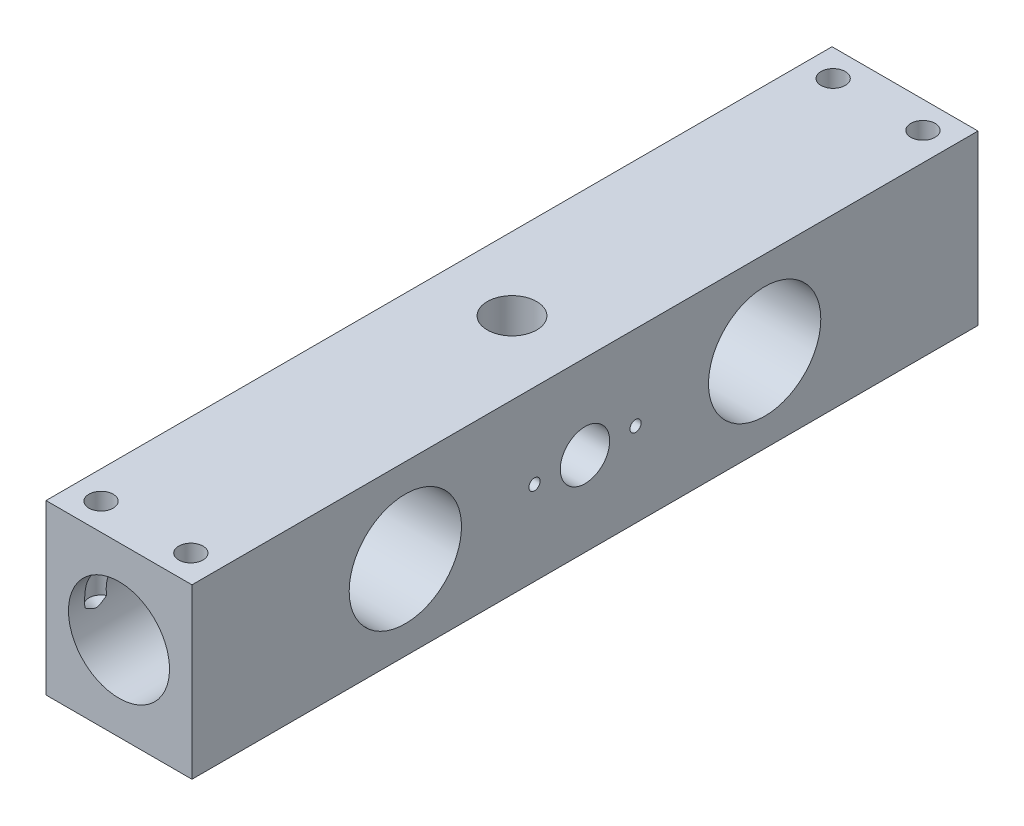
ISO-10303-21;
HEADER;
FILE_DESCRIPTION(('STEP AP214'),'2;1');
FILE_NAME('part.step','',(''),(''),'','','');
FILE_SCHEMA(('AUTOMOTIVE_DESIGN { 1 0 10303 214 1 1 1 1 }'));
ENDSEC;
DATA;
#1=APPLICATION_CONTEXT('core data for automotive mechanical design processes');
#2=APPLICATION_PROTOCOL_DEFINITION('international standard','automotive_design',2000,#1);
#3=PRODUCT_CONTEXT('',#1,'mechanical');
#4=PRODUCT('Part','Part','',(#3));
#5=PRODUCT_RELATED_PRODUCT_CATEGORY('part','',(#4));
#6=PRODUCT_DEFINITION_FORMATION('','',#4);
#7=PRODUCT_DEFINITION_CONTEXT('part definition',#1,'design');
#8=PRODUCT_DEFINITION('design','',#6,#7);
#9=PRODUCT_DEFINITION_SHAPE('','',#8);
#10=(LENGTH_UNIT() NAMED_UNIT(*) SI_UNIT(.MILLI.,.METRE.));
#11=(NAMED_UNIT(*) PLANE_ANGLE_UNIT() SI_UNIT($,.RADIAN.));
#12=(NAMED_UNIT(*) SI_UNIT($,.STERADIAN.) SOLID_ANGLE_UNIT());
#13=UNCERTAINTY_MEASURE_WITH_UNIT(LENGTH_MEASURE(1.E-05),#10,'distance_accuracy_value','');
#14=(GEOMETRIC_REPRESENTATION_CONTEXT(3) GLOBAL_UNCERTAINTY_ASSIGNED_CONTEXT((#13)) GLOBAL_UNIT_ASSIGNED_CONTEXT((#10,
#11,#12)) REPRESENTATION_CONTEXT('',''));
#15=CARTESIAN_POINT('',(0.,0.,0.));
#16=DIRECTION('',(0.,0.,1.));
#17=DIRECTION('',(1.,0.,0.));
#18=AXIS2_PLACEMENT_3D('',#15,#16,#17);
#19=CARTESIAN_POINT('',(0.,0.,-175.));
#20=DIRECTION('',(-1.,0.,0.));
#21=DIRECTION('',(0.,0.,1.));
#22=AXIS2_PLACEMENT_3D('',#19,#20,#21);
#23=PLANE('',#22);
#24=CARTESIAN_POINT('',(0.,37.5,-18.));
#25=DIRECTION('',(-1.,0.,0.));
#26=DIRECTION('',(0.,0.,1.));
#27=AXIS2_PLACEMENT_3D('',#24,#25,#26);
#28=CIRCLE('',#27,2.5);
#29=CARTESIAN_POINT('',(0.,37.5,-15.5));
#30=VERTEX_POINT('',#29);
#31=EDGE_CURVE('E288',#30,#30,#28,.T.);
#32=ORIENTED_EDGE('',*,*,#31,.F.);
#33=EDGE_LOOP('',(#32));
#34=FACE_BOUND('',#33,.T.);
#35=CARTESIAN_POINT('',(0.,37.5,-80.));
#36=DIRECTION('',(1.,0.,0.));
#37=DIRECTION('',(0.,0.,-1.));
#38=AXIS2_PLACEMENT_3D('',#35,#36,#37);
#39=CIRCLE('',#38,25.);
#40=CARTESIAN_POINT('',(0.,37.5,-105.));
#41=VERTEX_POINT('',#40);
#42=EDGE_CURVE('E292',#41,#41,#39,.T.);
#43=ORIENTED_EDGE('',*,*,#42,.T.);
#44=EDGE_LOOP('',(#43));
#45=FACE_BOUND('',#44,.T.);
#46=DIRECTION('',(0.,0.,1.));
#47=VECTOR('',#46,1.);
#48=CARTESIAN_POINT('',(0.,0.,-175.));
#49=LINE('',#48,#47);
#50=CARTESIAN_POINT('',(0.,0.,-175.));
#51=VERTEX_POINT('',#50);
#52=CARTESIAN_POINT('',(0.,0.,175.));
#53=VERTEX_POINT('',#52);
#54=EDGE_CURVE('E296',#51,#53,#49,.T.);
#55=ORIENTED_EDGE('',*,*,#54,.T.);
#56=DIRECTION('',(0.,-1.,0.));
#57=VECTOR('',#56,1.);
#58=CARTESIAN_POINT('',(0.,0.,175.));
#59=LINE('',#58,#57);
#60=CARTESIAN_POINT('',(0.,75.,175.));
#61=VERTEX_POINT('',#60);
#62=EDGE_CURVE('E203',#61,#53,#59,.T.);
#63=ORIENTED_EDGE('',*,*,#62,.F.);
#64=DIRECTION('',(0.,0.,1.));
#65=VECTOR('',#64,1.);
#66=CARTESIAN_POINT('',(0.,75.,-175.));
#67=LINE('',#66,#65);
#68=CARTESIAN_POINT('',(0.,75.,-175.));
#69=VERTEX_POINT('',#68);
#70=EDGE_CURVE('E394',#69,#61,#67,.T.);
#71=ORIENTED_EDGE('',*,*,#70,.F.);
#72=DIRECTION('',(0.,-1.,0.));
#73=VECTOR('',#72,1.);
#74=CARTESIAN_POINT('',(0.,0.,-175.));
#75=LINE('',#74,#73);
#76=EDGE_CURVE('E413',#69,#51,#75,.T.);
#77=ORIENTED_EDGE('',*,*,#76,.T.);
#78=EDGE_LOOP('',(#55,#63,#71,#77));
#79=FACE_BOUND('',#78,.T.);
#80=CARTESIAN_POINT('',(0.,37.5,18.));
#81=DIRECTION('',(1.,0.,0.));
#82=DIRECTION('',(0.,0.,-1.));
#83=AXIS2_PLACEMENT_3D('',#80,#81,#82);
#84=CIRCLE('',#83,2.5);
#85=CARTESIAN_POINT('',(0.,37.5,15.5));
#86=VERTEX_POINT('',#85);
#87=EDGE_CURVE('E166',#86,#86,#84,.T.);
#88=ORIENTED_EDGE('',*,*,#87,.T.);
#89=EDGE_LOOP('',(#88));
#90=FACE_BOUND('',#89,.T.);
#91=CARTESIAN_POINT('',(0.,37.5,80.));
#92=DIRECTION('',(-1.,0.,0.));
#93=DIRECTION('',(0.,0.,1.));
#94=AXIS2_PLACEMENT_3D('',#91,#92,#93);
#95=CIRCLE('',#94,25.);
#96=CARTESIAN_POINT('',(0.,37.5,105.));
#97=VERTEX_POINT('',#96);
#98=EDGE_CURVE('E200',#97,#97,#95,.T.);
#99=ORIENTED_EDGE('',*,*,#98,.F.);
#100=EDGE_LOOP('',(#99));
#101=FACE_BOUND('',#100,.T.);
#102=ADVANCED_FACE('F29',(#34,#45,#79,#90,#101),#23,.T.);
#103=CARTESIAN_POINT('',(0.,75.,-175.));
#104=DIRECTION('',(0.,1.,0.));
#105=DIRECTION('',(0.,0.,1.));
#106=AXIS2_PLACEMENT_3D('',#103,#104,#105);
#107=PLANE('',#106);
#108=CARTESIAN_POINT('',(32.5,75.,0.));
#109=DIRECTION('',(0.,-1.,0.));
#110=DIRECTION('',(0.,0.,-1.));
#111=AXIS2_PLACEMENT_3D('',#108,#109,#110);
#112=CIRCLE('',#111,11.);
#113=CARTESIAN_POINT('',(32.5,75.,-11.));
#114=VERTEX_POINT('',#113);
#115=EDGE_CURVE('E141',#114,#114,#112,.T.);
#116=ORIENTED_EDGE('',*,*,#115,.T.);
#117=EDGE_LOOP('',(#116));
#118=FACE_BOUND('',#117,.T.);
#119=CARTESIAN_POINT('',(12.5,75.,-163.));
#120=DIRECTION('',(0.,1.,0.));
#121=DIRECTION('',(0.,0.,1.));
#122=AXIS2_PLACEMENT_3D('',#119,#120,#121);
#123=CIRCLE('',#122,5.39999999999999);
#124=CARTESIAN_POINT('',(12.5,75.,-157.6));
#125=VERTEX_POINT('',#124);
#126=EDGE_CURVE('E390',#125,#125,#123,.T.);
#127=ORIENTED_EDGE('',*,*,#126,.F.);
#128=EDGE_LOOP('',(#127));
#129=FACE_BOUND('',#128,.T.);
#130=CARTESIAN_POINT('',(52.5,75.,-163.));
#131=DIRECTION('',(0.,1.,0.));
#132=DIRECTION('',(0.,0.,1.));
#133=AXIS2_PLACEMENT_3D('',#130,#131,#132);
#134=CIRCLE('',#133,5.4);
#135=CARTESIAN_POINT('',(52.5,75.,-157.6));
#136=VERTEX_POINT('',#135);
#137=EDGE_CURVE('E384',#136,#136,#134,.T.);
#138=ORIENTED_EDGE('',*,*,#137,.F.);
#139=EDGE_LOOP('',(#138));
#140=FACE_BOUND('',#139,.T.);
#141=ORIENTED_EDGE('',*,*,#70,.T.);
#142=DIRECTION('',(-1.,0.,0.));
#143=VECTOR('',#142,1.);
#144=CARTESIAN_POINT('',(0.,75.,175.));
#145=LINE('',#144,#143);
#146=CARTESIAN_POINT('',(65.,75.,175.));
#147=VERTEX_POINT('',#146);
#148=EDGE_CURVE('E212',#147,#61,#145,.T.);
#149=ORIENTED_EDGE('',*,*,#148,.F.);
#150=DIRECTION('',(0.,0.,1.));
#151=VECTOR('',#150,1.);
#152=CARTESIAN_POINT('',(65.,75.,-175.));
#153=LINE('',#152,#151);
#154=CARTESIAN_POINT('',(65.,75.,-175.));
#155=VERTEX_POINT('',#154);
#156=EDGE_CURVE('E395',#155,#147,#153,.T.);
#157=ORIENTED_EDGE('',*,*,#156,.F.);
#158=DIRECTION('',(-1.,0.,0.));
#159=VECTOR('',#158,1.);
#160=CARTESIAN_POINT('',(0.,75.,-175.));
#161=LINE('',#160,#159);
#162=EDGE_CURVE('E403',#155,#69,#161,.T.);
#163=ORIENTED_EDGE('',*,*,#162,.T.);
#164=EDGE_LOOP('',(#141,#149,#157,#163));
#165=FACE_BOUND('',#164,.T.);
#166=CARTESIAN_POINT('',(12.5,75.,163.));
#167=DIRECTION('',(0.,-1.,0.));
#168=DIRECTION('',(0.,0.,-1.));
#169=AXIS2_PLACEMENT_3D('',#166,#167,#168);
#170=CIRCLE('',#169,5.39999999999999);
#171=CARTESIAN_POINT('',(12.5,75.,157.6));
#172=VERTEX_POINT('',#171);
#173=EDGE_CURVE('E183',#172,#172,#170,.T.);
#174=ORIENTED_EDGE('',*,*,#173,.T.);
#175=EDGE_LOOP('',(#174));
#176=FACE_BOUND('',#175,.T.);
#177=CARTESIAN_POINT('',(52.5,75.,163.));
#178=DIRECTION('',(0.,-1.,0.));
#179=DIRECTION('',(0.,0.,-1.));
#180=AXIS2_PLACEMENT_3D('',#177,#178,#179);
#181=CIRCLE('',#180,5.4);
#182=CARTESIAN_POINT('',(52.5,75.,157.6));
#183=VERTEX_POINT('',#182);
#184=EDGE_CURVE('E188',#183,#183,#181,.T.);
#185=ORIENTED_EDGE('',*,*,#184,.T.);
#186=EDGE_LOOP('',(#185));
#187=FACE_BOUND('',#186,.T.);
#188=ADVANCED_FACE('F275',(#118,#129,#140,#165,#176,#187),#107,.T.);
#189=CARTESIAN_POINT('',(65.,0.,-175.));
#190=DIRECTION('',(1.,0.,0.));
#191=DIRECTION('',(0.,0.,-1.));
#192=AXIS2_PLACEMENT_3D('',#189,#190,#191);
#193=PLANE('',#192);
#194=CARTESIAN_POINT('',(65.,37.5,0.));
#195=DIRECTION('',(1.,0.,0.));
#196=DIRECTION('',(0.,0.,-1.));
#197=AXIS2_PLACEMENT_3D('',#194,#195,#196);
#198=CIRCLE('',#197,11.);
#199=CARTESIAN_POINT('',(65.,37.5,-11.));
#200=VERTEX_POINT('',#199);
#201=EDGE_CURVE('E151',#200,#200,#198,.T.);
#202=ORIENTED_EDGE('',*,*,#201,.F.);
#203=EDGE_LOOP('',(#202));
#204=FACE_BOUND('',#203,.T.);
#205=CARTESIAN_POINT('',(65.,37.5,-22.5));
#206=DIRECTION('',(1.,0.,0.));
#207=DIRECTION('',(0.,0.,-1.));
#208=AXIS2_PLACEMENT_3D('',#205,#206,#207);
#209=CIRCLE('',#208,2.5);
#210=CARTESIAN_POINT('',(65.,37.5,-25.));
#211=VERTEX_POINT('',#210);
#212=EDGE_CURVE('E447',#211,#211,#209,.T.);
#213=ORIENTED_EDGE('',*,*,#212,.F.);
#214=EDGE_LOOP('',(#213));
#215=FACE_BOUND('',#214,.T.);
#216=CARTESIAN_POINT('',(65.,37.5,-80.));
#217=DIRECTION('',(1.,0.,0.));
#218=DIRECTION('',(0.,0.,-1.));
#219=AXIS2_PLACEMENT_3D('',#216,#217,#218);
#220=CIRCLE('',#219,25.);
#221=CARTESIAN_POINT('',(65.,37.5,-105.));
#222=VERTEX_POINT('',#221);
#223=EDGE_CURVE('E418',#222,#222,#220,.T.);
#224=ORIENTED_EDGE('',*,*,#223,.F.);
#225=EDGE_LOOP('',(#224));
#226=FACE_BOUND('',#225,.T.);
#227=ORIENTED_EDGE('',*,*,#156,.T.);
#228=DIRECTION('',(0.,1.,0.));
#229=VECTOR('',#228,1.);
#230=CARTESIAN_POINT('',(65.,0.,175.));
#231=LINE('',#230,#229);
#232=CARTESIAN_POINT('',(65.,0.,175.));
#233=VERTEX_POINT('',#232);
#234=EDGE_CURVE('E209',#233,#147,#231,.T.);
#235=ORIENTED_EDGE('',*,*,#234,.F.);
#236=DIRECTION('',(0.,0.,1.));
#237=VECTOR('',#236,1.);
#238=CARTESIAN_POINT('',(65.,0.,-175.));
#239=LINE('',#238,#237);
#240=CARTESIAN_POINT('',(65.,0.,-175.));
#241=VERTEX_POINT('',#240);
#242=EDGE_CURVE('E400',#241,#233,#239,.T.);
#243=ORIENTED_EDGE('',*,*,#242,.F.);
#244=DIRECTION('',(0.,1.,0.));
#245=VECTOR('',#244,1.);
#246=CARTESIAN_POINT('',(65.,0.,-175.));
#247=LINE('',#246,#245);
#248=EDGE_CURVE('E406',#241,#155,#247,.T.);
#249=ORIENTED_EDGE('',*,*,#248,.T.);
#250=EDGE_LOOP('',(#227,#235,#243,#249));
#251=FACE_BOUND('',#250,.T.);
#252=CARTESIAN_POINT('',(65.,37.5,22.5));
#253=DIRECTION('',(-1.,0.,0.));
#254=DIRECTION('',(0.,0.,1.));
#255=AXIS2_PLACEMENT_3D('',#252,#253,#254);
#256=CIRCLE('',#255,2.5);
#257=CARTESIAN_POINT('',(65.,37.5,25.));
#258=VERTEX_POINT('',#257);
#259=EDGE_CURVE('E160',#258,#258,#256,.T.);
#260=ORIENTED_EDGE('',*,*,#259,.T.);
#261=EDGE_LOOP('',(#260));
#262=FACE_BOUND('',#261,.T.);
#263=CARTESIAN_POINT('',(65.,37.5,80.));
#264=DIRECTION('',(-1.,0.,0.));
#265=DIRECTION('',(0.,0.,1.));
#266=AXIS2_PLACEMENT_3D('',#263,#264,#265);
#267=CIRCLE('',#266,25.);
#268=CARTESIAN_POINT('',(65.,37.5,105.));
#269=VERTEX_POINT('',#268);
#270=EDGE_CURVE('E197',#269,#269,#267,.T.);
#271=ORIENTED_EDGE('',*,*,#270,.T.);
#272=EDGE_LOOP('',(#271));
#273=FACE_BOUND('',#272,.T.);
#274=ADVANCED_FACE('F282',(#204,#215,#226,#251,#262,#273),#193,.T.);
#275=CARTESIAN_POINT('',(0.,0.,-175.));
#276=DIRECTION('',(0.,-1.,0.));
#277=DIRECTION('',(0.,0.,-1.));
#278=AXIS2_PLACEMENT_3D('',#275,#276,#277);
#279=PLANE('',#278);
#280=CARTESIAN_POINT('',(32.5,0.,0.));
#281=DIRECTION('',(0.,-1.,0.));
#282=DIRECTION('',(0.,0.,-1.));
#283=AXIS2_PLACEMENT_3D('',#280,#281,#282);
#284=CIRCLE('',#283,11.);
#285=CARTESIAN_POINT('',(32.5,0.,-11.));
#286=VERTEX_POINT('',#285);
#287=EDGE_CURVE('E144',#286,#286,#284,.T.);
#288=ORIENTED_EDGE('',*,*,#287,.F.);
#289=EDGE_LOOP('',(#288));
#290=FACE_BOUND('',#289,.T.);
#291=CARTESIAN_POINT('',(32.5,0.,-24.));
#292=DIRECTION('',(0.,-1.,0.));
#293=DIRECTION('',(0.,0.,-1.));
#294=AXIS2_PLACEMENT_3D('',#291,#292,#293);
#295=CIRCLE('',#294,6.);
#296=CARTESIAN_POINT('',(32.5,0.,-30.));
#297=VERTEX_POINT('',#296);
#298=EDGE_CURVE('E453',#297,#297,#295,.T.);
#299=ORIENTED_EDGE('',*,*,#298,.F.);
#300=EDGE_LOOP('',(#299));
#301=FACE_BOUND('',#300,.T.);
#302=CARTESIAN_POINT('',(10.,0.,-112.));
#303=DIRECTION('',(0.,-1.,0.));
#304=DIRECTION('',(0.,0.,-1.));
#305=AXIS2_PLACEMENT_3D('',#302,#303,#304);
#306=CIRCLE('',#305,5.39999999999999);
#307=CARTESIAN_POINT('',(10.,0.,-117.4));
#308=VERTEX_POINT('',#307);
#309=EDGE_CURVE('E437',#308,#308,#306,.T.);
#310=ORIENTED_EDGE('',*,*,#309,.F.);
#311=EDGE_LOOP('',(#310));
#312=FACE_BOUND('',#311,.T.);
#313=CARTESIAN_POINT('',(55.,0.,-112.));
#314=DIRECTION('',(0.,-1.,0.));
#315=DIRECTION('',(0.,0.,-1.));
#316=AXIS2_PLACEMENT_3D('',#313,#314,#315);
#317=CIRCLE('',#316,5.39999999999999);
#318=CARTESIAN_POINT('',(55.,0.,-117.4));
#319=VERTEX_POINT('',#318);
#320=EDGE_CURVE('E431',#319,#319,#317,.T.);
#321=ORIENTED_EDGE('',*,*,#320,.F.);
#322=EDGE_LOOP('',(#321));
#323=FACE_BOUND('',#322,.T.);
#324=ORIENTED_EDGE('',*,*,#242,.T.);
#325=DIRECTION('',(1.,0.,0.));
#326=VECTOR('',#325,1.);
#327=CARTESIAN_POINT('',(0.,0.,175.));
#328=LINE('',#327,#326);
#329=EDGE_CURVE('E206',#53,#233,#328,.T.);
#330=ORIENTED_EDGE('',*,*,#329,.F.);
#331=ORIENTED_EDGE('',*,*,#54,.F.);
#332=DIRECTION('',(1.,0.,0.));
#333=VECTOR('',#332,1.);
#334=CARTESIAN_POINT('',(0.,0.,-175.));
#335=LINE('',#334,#333);
#336=EDGE_CURVE('E409',#51,#241,#335,.T.);
#337=ORIENTED_EDGE('',*,*,#336,.T.);
#338=EDGE_LOOP('',(#324,#330,#331,#337));
#339=FACE_BOUND('',#338,.T.);
#340=CARTESIAN_POINT('',(32.5,0.,24.));
#341=DIRECTION('',(0.,1.,0.));
#342=DIRECTION('',(0.,0.,1.));
#343=AXIS2_PLACEMENT_3D('',#340,#341,#342);
#344=CIRCLE('',#343,6.);
#345=CARTESIAN_POINT('',(32.5,0.,30.));
#346=VERTEX_POINT('',#345);
#347=EDGE_CURVE('E149',#346,#346,#344,.T.);
#348=ORIENTED_EDGE('',*,*,#347,.T.);
#349=EDGE_LOOP('',(#348));
#350=FACE_BOUND('',#349,.T.);
#351=CARTESIAN_POINT('',(10.,0.,112.));
#352=DIRECTION('',(0.,1.,0.));
#353=DIRECTION('',(0.,0.,1.));
#354=AXIS2_PLACEMENT_3D('',#351,#352,#353);
#355=CIRCLE('',#354,5.39999999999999);
#356=CARTESIAN_POINT('',(10.,0.,117.4));
#357=VERTEX_POINT('',#356);
#358=EDGE_CURVE('E172',#357,#357,#355,.T.);
#359=ORIENTED_EDGE('',*,*,#358,.T.);
#360=EDGE_LOOP('',(#359));
#361=FACE_BOUND('',#360,.T.);
#362=CARTESIAN_POINT('',(55.,0.,112.));
#363=DIRECTION('',(0.,1.,0.));
#364=DIRECTION('',(0.,0.,1.));
#365=AXIS2_PLACEMENT_3D('',#362,#363,#364);
#366=CIRCLE('',#365,5.39999999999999);
#367=CARTESIAN_POINT('',(55.,0.,117.4));
#368=VERTEX_POINT('',#367);
#369=EDGE_CURVE('E178',#368,#368,#366,.T.);
#370=ORIENTED_EDGE('',*,*,#369,.T.);
#371=EDGE_LOOP('',(#370));
#372=FACE_BOUND('',#371,.T.);
#373=ADVANCED_FACE('F308',(#290,#301,#312,#323,#339,#350,#361,#372),#279,.T.);
#374=CARTESIAN_POINT('',(0.,75.,-175.));
#375=DIRECTION('',(0.,0.,-1.));
#376=DIRECTION('',(-1.,0.,0.));
#377=AXIS2_PLACEMENT_3D('',#374,#375,#376);
#378=PLANE('',#377);
#379=CARTESIAN_POINT('',(32.5,37.5,-175.));
#380=DIRECTION('',(0.,0.,-1.));
#381=DIRECTION('',(-1.,0.,0.));
#382=AXIS2_PLACEMENT_3D('',#379,#380,#381);
#383=CIRCLE('',#382,22.5);
#384=CARTESIAN_POINT('',(10.,37.5,-175.));
#385=VERTEX_POINT('',#384);
#386=EDGE_CURVE('E421',#385,#385,#383,.T.);
#387=ORIENTED_EDGE('',*,*,#386,.F.);
#388=EDGE_LOOP('',(#387));
#389=FACE_BOUND('',#388,.T.);
#390=ORIENTED_EDGE('',*,*,#76,.F.);
#391=ORIENTED_EDGE('',*,*,#162,.F.);
#392=ORIENTED_EDGE('',*,*,#248,.F.);
#393=ORIENTED_EDGE('',*,*,#336,.F.);
#394=EDGE_LOOP('',(#390,#391,#392,#393));
#395=FACE_BOUND('',#394,.T.);
#396=ADVANCED_FACE('F314',(#389,#395),#378,.T.);
#397=CARTESIAN_POINT('',(0.,37.5,-80.));
#398=DIRECTION('',(1.,0.,0.));
#399=DIRECTION('',(0.,0.,-1.));
#400=AXIS2_PLACEMENT_3D('',#397,#398,#399);
#401=CYLINDRICAL_SURFACE('',#400,25.);
#402=ORIENTED_EDGE('',*,*,#42,.F.);
#403=EDGE_LOOP('',(#402));
#404=FACE_BOUND('',#403,.T.);
#405=ORIENTED_EDGE('',*,*,#223,.T.);
#406=EDGE_LOOP('',(#405));
#407=FACE_BOUND('',#406,.T.);
#408=ADVANCED_FACE('F320',(#404,#407),#401,.F.);
#409=CARTESIAN_POINT('',(32.5,37.5,-175.));
#410=DIRECTION('',(0.,0.,-1.));
#411=DIRECTION('',(-1.,0.,0.));
#412=AXIS2_PLACEMENT_3D('',#409,#410,#411);
#413=CYLINDRICAL_SURFACE('',#412,22.5);
#414=CARTESIAN_POINT('',(10.1054043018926,35.3246647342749,-168.436309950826));
#415=CARTESIAN_POINT('',(10.1115354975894,35.2615427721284,-168.324214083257));
#416=CARTESIAN_POINT('',(10.1179234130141,35.1985570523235,-168.212055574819));
#417=CARTESIAN_POINT('',(10.1311985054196,35.0729219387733,-167.987578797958));
#418=CARTESIAN_POINT('',(10.1380856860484,35.0102725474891,-167.875260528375));
#419=CARTESIAN_POINT('',(10.1594798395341,34.8228811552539,-167.537936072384));
#420=CARTESIAN_POINT('',(10.1747149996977,34.6987413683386,-167.31264070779));
#421=CARTESIAN_POINT('',(10.2071684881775,34.4511576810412,-166.857725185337));
#422=CARTESIAN_POINT('',(10.2244114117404,34.3277473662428,-166.628088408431));
#423=CARTESIAN_POINT('',(10.25135388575,34.1456711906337,-166.282142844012));
#424=CARTESIAN_POINT('',(10.2605135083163,34.0854910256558,-166.166589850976));
#425=CARTESIAN_POINT('',(10.279113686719,33.9664696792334,-165.934819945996));
#426=CARTESIAN_POINT('',(10.2885542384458,33.9076284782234,-165.818603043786));
#427=CARTESIAN_POINT('',(10.3095070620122,33.7801917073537,-165.562088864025));
#428=CARTESIAN_POINT('',(10.3210578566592,33.7119843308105,-165.421600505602));
#429=CARTESIAN_POINT('',(10.3441328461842,33.5792748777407,-165.138817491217));
#430=CARTESIAN_POINT('',(10.355657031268,33.5147740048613,-164.996522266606));
#431=CARTESIAN_POINT('',(10.3781931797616,33.3915257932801,-164.709720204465));
#432=CARTESIAN_POINT('',(10.38920616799,33.332766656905,-164.565218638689));
#433=CARTESIAN_POINT('',(10.4047709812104,33.2512790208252,-164.345958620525));
#434=CARTESIAN_POINT('',(10.4097989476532,33.2252309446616,-164.272473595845));
#435=CARTESIAN_POINT('',(10.4193967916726,33.1759289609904,-164.124511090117));
#436=CARTESIAN_POINT('',(10.4239665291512,33.1526759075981,-164.050033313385));
#437=CARTESIAN_POINT('',(10.4335600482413,33.1042084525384,-163.880986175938));
#438=CARTESIAN_POINT('',(10.4384048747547,33.0799932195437,-163.786113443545));
#439=CARTESIAN_POINT('',(10.4467200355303,33.0386895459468,-163.594793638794));
#440=CARTESIAN_POINT('',(10.4501912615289,33.0215964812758,-163.498347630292));
#441=CARTESIAN_POINT('',(10.4553642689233,32.9962007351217,-163.304954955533));
#442=CARTESIAN_POINT('',(10.457079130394,32.9878330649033,-163.208017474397));
#443=CARTESIAN_POINT('',(10.4585564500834,32.9806214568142,-163.013767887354));
#444=CARTESIAN_POINT('',(10.4583190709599,32.981776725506,-162.916455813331));
#445=CARTESIAN_POINT('',(10.4559338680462,32.9934293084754,-162.723070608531));
#446=CARTESIAN_POINT('',(10.4537984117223,33.0038661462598,-162.62699353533));
#447=CARTESIAN_POINT('',(10.4479038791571,33.0328677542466,-162.43613964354));
#448=CARTESIAN_POINT('',(10.4441443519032,33.0514347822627,-162.341363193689));
#449=CARTESIAN_POINT('',(10.4352955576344,33.0955331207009,-162.151670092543));
#450=CARTESIAN_POINT('',(10.4301827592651,33.1211880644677,-162.056783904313));
#451=CARTESIAN_POINT('',(10.4218287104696,33.1635773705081,-161.91570263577));
#452=CARTESIAN_POINT('',(10.4189298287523,33.178358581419,-161.868882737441));
#453=CARTESIAN_POINT('',(10.4129437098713,33.2090573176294,-161.775630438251));
#454=CARTESIAN_POINT('',(10.4098564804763,33.2249747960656,-161.729198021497));
#455=CARTESIAN_POINT('',(10.4001397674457,33.2753849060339,-161.587092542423));
#456=CARTESIAN_POINT('',(10.3932617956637,33.3114928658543,-161.492009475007));
#457=CARTESIAN_POINT('',(10.3791199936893,33.3868333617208,-161.303112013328));
#458=CARTESIAN_POINT('',(10.3718560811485,33.4260665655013,-161.209297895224));
#459=CARTESIAN_POINT('',(10.357126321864,33.5069017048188,-161.022640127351));
#460=CARTESIAN_POINT('',(10.3496603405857,33.5485052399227,-160.929797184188));
#461=CARTESIAN_POINT('',(10.3346654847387,33.6335012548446,-160.744936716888));
#462=CARTESIAN_POINT('',(10.3271366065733,33.6768938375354,-160.652919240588));
#463=CARTESIAN_POINT('',(10.3045645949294,33.8093814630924,-160.377300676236));
#464=CARTESIAN_POINT('',(10.2895813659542,33.9005396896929,-160.194688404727));
#465=CARTESIAN_POINT('',(10.2602862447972,34.0862063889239,-159.831232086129));
#466=CARTESIAN_POINT('',(10.2459740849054,34.1807134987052,-159.6503873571));
#467=CARTESIAN_POINT('',(10.2198000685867,34.3615129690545,-159.309557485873));
#468=CARTESIAN_POINT('',(10.2078414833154,34.4475721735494,-159.149455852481));
#469=CARTESIAN_POINT('',(10.1847826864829,34.6209843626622,-158.829869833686));
#470=CARTESIAN_POINT('',(10.1736825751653,34.708337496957,-158.670385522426));
#471=CARTESIAN_POINT('',(10.1524844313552,34.8834607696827,-158.352833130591));
#472=CARTESIAN_POINT('',(10.1423807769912,34.9712252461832,-158.194762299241));
#473=CARTESIAN_POINT('',(10.1231493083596,35.1474632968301,-157.878985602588));
#474=CARTESIAN_POINT('',(10.1140213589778,35.2359367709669,-157.72127968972));
#475=CARTESIAN_POINT('',(10.1054043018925,35.3246647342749,-157.563690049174));
#476=B_SPLINE_CURVE_WITH_KNOTS('',3,(#414,#415,#416,#417,#418,#419,#420,#421,#422,#423,#424,
#425,#426,#427,#428,#429,#430,#431,#432,#433,#434,#435,#436,#437,#438,#439,#440,#441,#442,#443,
#444,#445,#446,#447,#448,#449,#450,#451,#452,#453,#454,#455,#456,#457,#458,#459,#460,#461,#462,
#463,#464,#465,#466,#467,#468,#469,#470,#471,#472,#473,#474,#475),.UNSPECIFIED.,.F.,.F.,(4,2,2,
2,2,2,2,2,2,2,2,2,2,2,2,2,2,2,2,2,2,2,2,2,2,2,2,2,2,2,4),(0.,0.386376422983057,
0.772755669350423,1.54579169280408,2.32955943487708,2.72137192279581,3.11317868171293,
3.58293038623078,4.05283378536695,4.52175041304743,4.75608589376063,4.99049280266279,
5.28437137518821,5.57805884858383,5.86954289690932,6.16100265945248,6.4505771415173,
6.74023209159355,7.03529869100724,7.18283717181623,7.3303695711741,7.63610529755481,
7.94190652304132,8.24791661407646,8.55394432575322,9.16782587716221,9.78146041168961,
10.3279261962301,10.8744556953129,11.4177003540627,11.9608696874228),.UNSPECIFIED.);
#477=CARTESIAN_POINT('',(10.1393202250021,35.,-167.856664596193));
#478=VERTEX_POINT('',#477);
#479=CARTESIAN_POINT('',(10.1393202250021,35.,-158.143335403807));
#480=VERTEX_POINT('',#479);
#481=EDGE_CURVE('E349',#478,#480,#476,.T.);
#482=ORIENTED_EDGE('',*,*,#481,.T.);
#483=CARTESIAN_POINT('',(10.1393202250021,35.,-158.143335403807));
#484=CARTESIAN_POINT('',(10.1076087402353,35.2835908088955,-158.158794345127));
#485=CARTESIAN_POINT('',(10.0812870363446,35.567920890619,-158.171930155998));
#486=CARTESIAN_POINT('',(10.0394724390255,36.1375730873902,-158.19308090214));
#487=CARTESIAN_POINT('',(10.0239798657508,36.4228952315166,-158.201095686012));
#488=CARTESIAN_POINT('',(10.0038828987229,36.9937941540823,-158.211524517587));
#489=CARTESIAN_POINT('',(9.99926959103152,37.2793705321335,-158.213943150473));
#490=CARTESIAN_POINT('',(10.0009177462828,37.8504767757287,-158.213080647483));
#491=CARTESIAN_POINT('',(10.0071789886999,38.1360066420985,-158.20979962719));
#492=CARTESIAN_POINT('',(10.0305675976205,38.7067543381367,-158.197701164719));
#493=CARTESIAN_POINT('',(10.0477045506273,38.9919716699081,-158.188878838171));
#494=CARTESIAN_POINT('',(10.0928045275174,39.5613470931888,-158.166156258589));
#495=CARTESIAN_POINT('',(10.1207677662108,39.8455051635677,-158.152255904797));
#496=CARTESIAN_POINT('',(10.1874524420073,40.4123289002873,-158.12009266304));
#497=CARTESIAN_POINT('',(10.2261746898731,40.6949944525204,-158.101829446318));
#498=CARTESIAN_POINT('',(10.3142891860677,41.2583966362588,-158.061883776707));
#499=CARTESIAN_POINT('',(10.3636814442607,41.5391332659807,-158.040201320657));
#500=CARTESIAN_POINT('',(10.5291534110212,42.3851789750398,-157.97105503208));
#501=CARTESIAN_POINT('',(10.6616740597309,42.9470495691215,-157.919956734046));
#502=CARTESIAN_POINT('',(10.9695729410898,44.0592514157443,-157.818878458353));
#503=CARTESIAN_POINT('',(11.1449658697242,44.6095786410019,-157.768898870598));
#504=CARTESIAN_POINT('',(11.4392887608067,45.4233361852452,-157.70425719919));
#505=CARTESIAN_POINT('',(11.5423864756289,45.6921552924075,-157.684457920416));
#506=CARTESIAN_POINT('',(11.7589424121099,46.2259068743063,-157.649965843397));
#507=CARTESIAN_POINT('',(11.8723993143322,46.4908398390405,-157.635272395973));
#508=CARTESIAN_POINT('',(12.1094419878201,47.0162036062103,-157.612827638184));
#509=CARTESIAN_POINT('',(12.2330200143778,47.2766376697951,-157.605071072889));
#510=CARTESIAN_POINT('',(12.4901278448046,47.7926219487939,-157.598477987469));
#511=CARTESIAN_POINT('',(12.6236554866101,48.04817321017,-157.599639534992));
#512=CARTESIAN_POINT('',(12.8833315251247,48.5227139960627,-157.612253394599));
#513=CARTESIAN_POINT('',(13.0083741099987,48.7423412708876,-157.622425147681));
#514=CARTESIAN_POINT('',(13.265462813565,49.176740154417,-157.652961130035));
#515=CARTESIAN_POINT('',(13.3975083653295,49.3915121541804,-157.673324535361));
#516=CARTESIAN_POINT('',(13.6682396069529,49.8157702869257,-157.726077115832));
#517=CARTESIAN_POINT('',(13.8069341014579,50.0252488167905,-157.758482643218));
#518=CARTESIAN_POINT('',(14.0899848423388,50.4376924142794,-157.837294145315));
#519=CARTESIAN_POINT('',(14.2343410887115,50.6406574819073,-157.883700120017));
#520=CARTESIAN_POINT('',(14.5295705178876,51.0416570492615,-157.993406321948));
#521=CARTESIAN_POINT('',(14.6805059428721,51.2395856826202,-158.056929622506));
#522=CARTESIAN_POINT('',(14.9853310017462,51.6261086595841,-158.20294894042));
#523=CARTESIAN_POINT('',(15.1392212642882,51.8147009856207,-158.285449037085));
#524=CARTESIAN_POINT('',(15.4470774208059,52.1800772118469,-158.471539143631));
#525=CARTESIAN_POINT('',(15.6010414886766,52.3568970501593,-158.575060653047));
#526=CARTESIAN_POINT('',(15.9061969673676,52.6969699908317,-158.805435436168));
#527=CARTESIAN_POINT('',(16.0573906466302,52.8602346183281,-158.932268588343));
#528=CARTESIAN_POINT('',(16.3762715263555,53.1951142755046,-159.233088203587));
#529=CARTESIAN_POINT('',(16.5428505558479,53.3640563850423,-159.411344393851));
#530=CARTESIAN_POINT('',(16.7798002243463,53.5977572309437,-159.704675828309));
#531=CARTESIAN_POINT('',(16.8566592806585,53.6723987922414,-159.806824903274));
#532=CARTESIAN_POINT('',(17.004933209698,53.8145151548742,-160.019668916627));
#533=CARTESIAN_POINT('',(17.0763506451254,53.8819933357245,-160.130359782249));
#534=CARTESIAN_POINT('',(17.2132425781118,54.0098128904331,-160.361150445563));
#535=CARTESIAN_POINT('',(17.2786502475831,54.0700758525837,-160.481333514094));
#536=CARTESIAN_POINT('',(17.4014197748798,54.1820195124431,-160.729486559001));
#537=CARTESIAN_POINT('',(17.4587857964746,54.2337046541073,-160.857452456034));
#538=CARTESIAN_POINT('',(17.5642734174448,54.3279255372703,-161.120323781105));
#539=CARTESIAN_POINT('',(17.6123987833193,54.3704650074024,-161.255226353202));
#540=CARTESIAN_POINT('',(17.6983211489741,54.4459015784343,-161.530889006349));
#541=CARTESIAN_POINT('',(17.7361200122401,54.4788004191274,-161.671648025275));
#542=CARTESIAN_POINT('',(17.7960949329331,54.5307523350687,-161.93819665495));
#543=CARTESIAN_POINT('',(17.8196962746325,54.551079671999,-162.063419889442));
#544=CARTESIAN_POINT('',(17.858056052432,54.5840311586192,-162.316208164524));
#545=CARTESIAN_POINT('',(17.8728155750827,54.5966562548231,-162.443772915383));
#546=CARTESIAN_POINT('',(17.8931981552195,54.6140737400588,-162.700103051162));
#547=CARTESIAN_POINT('',(17.8988253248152,54.6188696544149,-162.828867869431));
#548=CARTESIAN_POINT('',(17.900843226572,54.6205906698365,-163.086520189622));
#549=CARTESIAN_POINT('',(17.8972344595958,54.6175161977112,-163.215407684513));
#550=CARTESIAN_POINT('',(17.8816394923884,54.6041990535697,-163.459889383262));
#551=CARTESIAN_POINT('',(17.8704865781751,54.5946692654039,-163.575577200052));
#552=CARTESIAN_POINT('',(17.8408649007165,54.5692747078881,-163.805346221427));
#553=CARTESIAN_POINT('',(17.8223938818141,54.5534079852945,-163.919426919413));
#554=CARTESIAN_POINT('',(17.7784392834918,54.5154779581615,-164.145115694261));
#555=CARTESIAN_POINT('',(17.7529592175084,54.4934177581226,-164.256724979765));
#556=CARTESIAN_POINT('',(17.6953634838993,54.4432640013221,-164.476872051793));
#557=CARTESIAN_POINT('',(17.6632453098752,54.4151681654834,-164.585408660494));
#558=CARTESIAN_POINT('',(17.5922660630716,54.3526478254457,-164.800516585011));
#559=CARTESIAN_POINT('',(17.5533025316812,54.3181265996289,-164.907025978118));
#560=CARTESIAN_POINT('',(17.4695675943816,54.2433346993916,-165.115668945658));
#561=CARTESIAN_POINT('',(17.4247941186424,54.2030619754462,-165.217800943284));
#562=CARTESIAN_POINT('',(17.2826665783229,54.0740490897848,-165.51688825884));
#563=CARTESIAN_POINT('',(17.1774573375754,53.977072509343,-165.706677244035));
#564=CARTESIAN_POINT('',(16.9386608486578,53.7519074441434,-166.084433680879));
#565=CARTESIAN_POINT('',(16.8032179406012,53.6214454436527,-166.269843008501));
#566=CARTESIAN_POINT('',(16.5193159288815,53.3400648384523,-166.613138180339));
#567=CARTESIAN_POINT('',(16.3708484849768,53.1891330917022,-166.771006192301));
#568=CARTESIAN_POINT('',(16.0987046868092,52.9038263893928,-167.029487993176));
#569=CARTESIAN_POINT('',(15.9763883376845,52.772653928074,-167.135158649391));
#570=CARTESIAN_POINT('',(15.7294059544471,52.5010288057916,-167.33079214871));
#571=CARTESIAN_POINT('',(15.6047388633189,52.3605718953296,-167.42074772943));
#572=CARTESIAN_POINT('',(15.3547794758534,52.0714788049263,-167.586146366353));
#573=CARTESIAN_POINT('',(15.2294864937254,51.922829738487,-167.661565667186));
#574=CARTESIAN_POINT('',(14.9799108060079,51.6186131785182,-167.798993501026));
#575=CARTESIAN_POINT('',(14.8556284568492,51.4630433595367,-167.860997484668));
#576=CARTESIAN_POINT('',(14.541941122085,51.059290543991,-168.003427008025));
#577=CARTESIAN_POINT('',(14.3540482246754,50.8069388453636,-168.075413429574));
#578=CARTESIAN_POINT('',(13.9865211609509,50.2906883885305,-168.194961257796));
#579=CARTESIAN_POINT('',(13.8068917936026,50.0267830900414,-168.242508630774));
#580=CARTESIAN_POINT('',(13.457521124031,49.489037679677,-168.317436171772));
#581=CARTESIAN_POINT('',(13.2878006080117,49.2151785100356,-168.344775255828));
#582=CARTESIAN_POINT('',(12.9598708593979,48.6596336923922,-168.382913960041));
#583=CARTESIAN_POINT('',(12.8016606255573,48.3779487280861,-168.393715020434));
#584=CARTESIAN_POINT('',(12.5184870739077,47.8473029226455,-168.401559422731));
#585=CARTESIAN_POINT('',(12.3919505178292,47.599198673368,-168.400297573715));
#586=CARTESIAN_POINT('',(12.1482263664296,47.0985858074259,-168.389909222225));
#587=CARTESIAN_POINT('',(12.031040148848,46.8460765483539,-168.380781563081));
#588=CARTESIAN_POINT('',(11.6936978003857,46.0823966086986,-168.344264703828));
#589=CARTESIAN_POINT('',(11.4878622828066,45.5652693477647,-168.307741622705));
#590=CARTESIAN_POINT('',(11.1151644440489,44.517722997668,-168.22290503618));
#591=CARTESIAN_POINT('',(10.9483412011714,43.9872911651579,-168.174579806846));
#592=CARTESIAN_POINT('',(10.6544228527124,42.9156459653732,-168.07719018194));
#593=CARTESIAN_POINT('',(10.5273184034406,42.3744351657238,-168.028125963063));
#594=CARTESIAN_POINT('',(10.3655513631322,41.5493730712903,-167.960605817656));
#595=CARTESIAN_POINT('',(10.3160244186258,41.2686286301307,-167.938885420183));
#596=CARTESIAN_POINT('',(10.2276411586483,40.7052031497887,-167.898852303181));
#597=CARTESIAN_POINT('',(10.1887848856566,40.4225221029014,-167.880539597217));
#598=CARTESIAN_POINT('',(10.1218340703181,39.85566147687,-167.848268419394));
#599=CARTESIAN_POINT('',(10.0937387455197,39.5714820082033,-167.834309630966));
#600=CARTESIAN_POINT('',(10.0483766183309,39.0020576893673,-167.811464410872));
#601=CARTESIAN_POINT('',(10.0311096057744,38.7168128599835,-167.802577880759));
#602=CARTESIAN_POINT('',(10.0074304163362,38.1452067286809,-167.790331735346));
#603=CARTESIAN_POINT('',(10.0010390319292,37.8588443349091,-167.786982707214));
#604=CARTESIAN_POINT('',(9.99919429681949,37.2860678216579,-167.786017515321));
#605=CARTESIAN_POINT('',(10.0037411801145,36.999653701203,-167.788401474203));
#606=CARTESIAN_POINT('',(10.0237691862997,36.4270770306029,-167.798795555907));
#607=CARTESIAN_POINT('',(10.0392593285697,36.1409148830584,-167.80681031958));
#608=CARTESIAN_POINT('',(10.0811327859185,35.5695872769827,-167.827992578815));
#609=CARTESIAN_POINT('',(10.107515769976,35.2844217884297,-167.841159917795));
#610=CARTESIAN_POINT('',(10.1393202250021,35.,-167.856664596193));
#611=B_SPLINE_CURVE_WITH_KNOTS('',3,(#483,#484,#485,#486,#487,#488,#489,#490,#491,#492,#493,
#494,#495,#496,#497,#498,#499,#500,#501,#502,#503,#504,#505,#506,#507,#508,#509,#510,#511,#512,
#513,#514,#515,#516,#517,#518,#519,#520,#521,#522,#523,#524,#525,#526,#527,#528,#529,#530,#531,
#532,#533,#534,#535,#536,#537,#538,#539,#540,#541,#542,#543,#544,#545,#546,#547,#548,#549,#550,
#551,#552,#553,#554,#555,#556,#557,#558,#559,#560,#561,#562,#563,#564,#565,#566,#567,#568,#569,
#570,#571,#572,#573,#574,#575,#576,#577,#578,#579,#580,#581,#582,#583,#584,#585,#586,#587,#588,
#589,#590,#591,#592,#593,#594,#595,#596,#597,#598,#599,#600,#601,#602,#603,#604,#605,#606,#607,
#608,#609,#610),.UNSPECIFIED.,.F.,.F.,(4,2,2,2,2,2,2,2,2,2,2,2,2,2,2,2,2,2,2,2,2,2,2,2,2,2,2,2,
2,2,2,2,2,2,2,2,2,2,2,2,2,2,2,2,2,2,2,2,2,2,2,2,2,2,2,2,2,2,2,2,2,2,2,4),(0.,0.857284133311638,
1.71459361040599,2.57120040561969,3.42778982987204,4.28513535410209,5.14249789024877,
5.99992505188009,6.85735300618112,8.59416395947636,10.3315711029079,11.1971348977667,
12.0625886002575,12.9273861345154,13.7919962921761,14.550486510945,15.3089154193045,
16.0683779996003,16.8278405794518,17.5977239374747,18.3677729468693,19.1353518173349,
19.9022712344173,20.7888728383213,21.2325391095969,21.6759951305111,22.123901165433,
22.5715744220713,23.0190648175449,23.4664744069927,23.8530605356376,24.2395991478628,
24.6259636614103,25.0123072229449,25.3617409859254,25.7112825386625,26.0606491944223,
26.4101480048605,26.7654101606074,27.1207992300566,27.8311145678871,28.6205579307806,
29.4105105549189,30.0341802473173,30.6581373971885,31.2831057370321,31.9082856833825,
32.8749775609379,33.8422239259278,34.8114313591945,35.7805543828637,36.615763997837,
37.4510964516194,39.1224239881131,40.7954185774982,42.4680193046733,43.3255522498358,
44.1830886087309,45.0405626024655,45.8980199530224,46.7571147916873,47.6162280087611,
48.4760501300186,49.3358461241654),.UNSPECIFIED.);
#612=EDGE_CURVE('E132',#480,#478,#611,.T.);
#613=ORIENTED_EDGE('',*,*,#612,.T.);
#614=EDGE_LOOP('',(#482,#613));
#615=FACE_BOUND('',#614,.T.);
#616=CARTESIAN_POINT('',(54.9809642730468,36.5746647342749,-157.602558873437));
#617=CARTESIAN_POINT('',(54.978337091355,36.5108283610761,-157.718284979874));
#618=CARTESIAN_POINT('',(54.9754446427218,36.4471841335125,-157.834111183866));
#619=CARTESIAN_POINT('',(54.9691455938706,36.3203713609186,-158.066012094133));
#620=CARTESIAN_POINT('',(54.9657389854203,36.2572028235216,-158.182086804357));
#621=CARTESIAN_POINT('',(54.9547680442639,36.0684719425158,-158.53089651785));
#622=CARTESIAN_POINT('',(54.9464559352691,35.9437647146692,-158.76407191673));
#623=CARTESIAN_POINT('',(54.9277900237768,35.6943817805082,-159.238624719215));
#624=CARTESIAN_POINT('',(54.9173862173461,35.5698018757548,-159.480050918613));
#625=CARTESIAN_POINT('',(54.900687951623,35.3874368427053,-159.84436013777));
#626=CARTESIAN_POINT('',(54.8949405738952,35.3274066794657,-159.96614251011));
#627=CARTESIAN_POINT('',(54.8831721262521,35.2093408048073,-160.21065489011));
#628=CARTESIAN_POINT('',(54.8771510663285,35.1513050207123,-160.333384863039));
#629=CARTESIAN_POINT('',(54.8641653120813,35.0305353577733,-160.596064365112));
#630=CARTESIAN_POINT('',(54.8571795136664,34.9681683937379,-160.736182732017));
#631=CARTESIAN_POINT('',(54.8432732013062,34.8482491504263,-161.018540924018));
#632=CARTESIAN_POINT('',(54.8363527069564,34.7906982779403,-161.160781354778));
#633=CARTESIAN_POINT('',(54.8230313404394,34.6830537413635,-161.446901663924));
#634=CARTESIAN_POINT('',(54.8166269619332,34.6329074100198,-161.590761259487));
#635=CARTESIAN_POINT('',(54.8048700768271,34.5428328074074,-161.881720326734));
#636=CARTESIAN_POINT('',(54.7995169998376,34.5028989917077,-162.028817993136));
#637=CARTESIAN_POINT('',(54.7918633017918,34.4465739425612,-162.285386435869));
#638=CARTESIAN_POINT('',(54.7891280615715,34.4267281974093,-162.394072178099));
#639=CARTESIAN_POINT('',(54.7849234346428,34.396384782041,-162.612765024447));
#640=CARTESIAN_POINT('',(54.7834535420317,34.3858833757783,-162.722771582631));
#641=CARTESIAN_POINT('',(54.7819793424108,34.3753513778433,-162.943013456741));
#642=CARTESIAN_POINT('',(54.7819710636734,34.3752924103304,-163.053247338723));
#643=CARTESIAN_POINT('',(54.7834104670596,34.3855755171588,-163.273217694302));
#644=CARTESIAN_POINT('',(54.7848584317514,34.3959196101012,-163.38295406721));
#645=CARTESIAN_POINT('',(54.7899188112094,34.4324293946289,-163.648302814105));
#646=CARTESIAN_POINT('',(54.7941967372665,34.4635047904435,-163.803216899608));
#647=CARTESIAN_POINT('',(54.804456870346,34.5398214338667,-164.109461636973));
#648=CARTESIAN_POINT('',(54.810441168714,34.5850800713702,-164.260787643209));
#649=CARTESIAN_POINT('',(54.8234012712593,34.6860361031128,-164.562602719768));
#650=CARTESIAN_POINT('',(54.8303919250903,34.7418947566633,-164.713035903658));
#651=CARTESIAN_POINT('',(54.8446885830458,34.8602184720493,-165.011131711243));
#652=CARTESIAN_POINT('',(54.8519944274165,34.9226802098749,-165.158795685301));
#653=CARTESIAN_POINT('',(54.86600647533,35.047367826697,-165.441358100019));
#654=CARTESIAN_POINT('',(54.8727173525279,35.1092748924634,-165.576398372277));
#655=CARTESIAN_POINT('',(54.8858836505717,35.2358742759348,-165.8451843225));
#656=CARTESIAN_POINT('',(54.8923390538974,35.3005667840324,-165.978929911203));
#657=CARTESIAN_POINT('',(54.904861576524,35.4320199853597,-166.245487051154));
#658=CARTESIAN_POINT('',(54.910928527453,35.4987815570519,-166.378298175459));
#659=CARTESIAN_POINT('',(54.9225787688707,35.6338390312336,-166.643159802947));
#660=CARTESIAN_POINT('',(54.9281620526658,35.7021349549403,-166.775210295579));
#661=CARTESIAN_POINT('',(54.9385115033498,35.8364179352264,-167.032052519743));
#662=CARTESIAN_POINT('',(54.9433047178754,35.9023470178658,-167.156873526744));
#663=CARTESIAN_POINT('',(54.9523568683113,36.0350444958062,-167.406089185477));
#664=CARTESIAN_POINT('',(54.956615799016,36.1018128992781,-167.530483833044));
#665=CARTESIAN_POINT('',(54.9645652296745,36.2359521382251,-167.778801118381));
#666=CARTESIAN_POINT('',(54.9682563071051,36.3033222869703,-167.902724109));
#667=CARTESIAN_POINT('',(54.9750539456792,36.4386113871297,-168.150282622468));
#668=CARTESIAN_POINT('',(54.97816052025,36.5065303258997,-168.273918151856));
#669=CARTESIAN_POINT('',(54.9809642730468,36.5746647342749,-168.397441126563));
#670=B_SPLINE_CURVE_WITH_KNOTS('',3,(#616,#617,#618,#619,#620,#621,#622,#623,#624,#625,#626,
#627,#628,#629,#630,#631,#632,#633,#634,#635,#636,#637,#638,#639,#640,#641,#642,#643,#644,#645,
#646,#647,#648,#649,#650,#651,#652,#653,#654,#655,#656,#657,#658,#659,#660,#661,#662,#663,#664,
#665,#666,#667,#668,#669),.UNSPECIFIED.,.F.,.F.,(4,2,2,2,2,2,2,2,2,2,2,2,2,2,2,2,2,2,2,2,2,2,2,
2,2,2,4),(0.,0.396573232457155,0.793152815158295,1.58680991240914,2.40236443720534,
2.8100376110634,3.21769591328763,3.67822649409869,4.13889113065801,4.59610249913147,
5.05306511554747,5.38427682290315,5.71535604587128,6.04553559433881,6.37577922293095,
6.84893925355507,7.32268170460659,7.80431200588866,8.2857009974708,8.7317771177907,
9.17788377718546,9.62418250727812,10.0704874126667,10.4942150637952,10.9179468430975,
11.3412448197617,11.7645330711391),.UNSPECIFIED.);
#671=CARTESIAN_POINT('',(54.9652509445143,36.25,-158.195571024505));
#672=VERTEX_POINT('',#671);
#673=CARTESIAN_POINT('',(54.9652509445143,36.25,-167.804428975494));
#674=VERTEX_POINT('',#673);
#675=EDGE_CURVE('E335',#672,#674,#670,.T.);
#676=ORIENTED_EDGE('',*,*,#675,.T.);
#677=CARTESIAN_POINT('',(54.9652509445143,36.25,-167.804428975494));
#678=CARTESIAN_POINT('',(54.9732572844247,36.3938901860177,-167.800318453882));
#679=CARTESIAN_POINT('',(54.9798818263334,36.5378726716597,-167.79689660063));
#680=CARTESIAN_POINT('',(54.9903635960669,36.8259651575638,-167.791464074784));
#681=CARTESIAN_POINT('',(54.9942208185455,36.9700751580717,-167.789453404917));
#682=CARTESIAN_POINT('',(55.0016352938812,37.4024751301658,-167.78558926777));
#683=CARTESIAN_POINT('',(55.0010372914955,37.6908698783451,-167.785902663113));
#684=CARTESIAN_POINT('',(54.9887661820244,38.2670359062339,-167.792294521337));
#685=CARTESIAN_POINT('',(54.977105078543,38.5548075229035,-167.798366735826));
#686=CARTESIAN_POINT('',(54.9427607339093,39.1295276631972,-167.815941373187));
#687=CARTESIAN_POINT('',(54.9200774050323,39.4164761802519,-167.827443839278));
#688=CARTESIAN_POINT('',(54.8634762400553,39.991848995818,-167.855407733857));
#689=CARTESIAN_POINT('',(54.8294509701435,40.2802603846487,-167.871916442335));
#690=CARTESIAN_POINT('',(54.750308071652,40.8552985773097,-167.908973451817));
#691=CARTESIAN_POINT('',(54.705190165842,41.1419253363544,-167.929521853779));
#692=CARTESIAN_POINT('',(54.6039448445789,41.7130447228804,-167.973576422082));
#693=CARTESIAN_POINT('',(54.5478155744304,41.9975369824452,-167.997083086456));
#694=CARTESIAN_POINT('',(54.4246421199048,42.563998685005,-168.045803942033));
#695=CARTESIAN_POINT('',(54.3575979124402,42.8459681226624,-168.071018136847));
#696=CARTESIAN_POINT('',(54.2110907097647,43.413224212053,-168.122335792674));
#697=CARTESIAN_POINT('',(54.131387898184,43.6984482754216,-168.148446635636));
#698=CARTESIAN_POINT('',(53.9607541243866,44.2656288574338,-168.199435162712));
#699=CARTESIAN_POINT('',(53.8698232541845,44.5475854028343,-168.224312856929));
#700=CARTESIAN_POINT('',(53.6767563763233,45.1080811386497,-168.271159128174));
#701=CARTESIAN_POINT('',(53.5746135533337,45.3866181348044,-168.293125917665));
#702=CARTESIAN_POINT('',(53.3592824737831,45.9396908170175,-168.332317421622));
#703=CARTESIAN_POINT('',(53.2460958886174,46.2142271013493,-168.349542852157));
#704=CARTESIAN_POINT('',(53.0097569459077,46.7567109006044,-168.377191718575));
#705=CARTESIAN_POINT('',(52.8866919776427,47.0246936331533,-168.387668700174));
#706=CARTESIAN_POINT('',(52.6300132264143,47.5558221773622,-168.399963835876));
#707=CARTESIAN_POINT('',(52.4963983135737,47.8189674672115,-168.401781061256));
#708=CARTESIAN_POINT('',(52.2191736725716,48.3393250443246,-168.39447295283));
#709=CARTESIAN_POINT('',(52.0755786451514,48.5965453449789,-168.385363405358));
#710=CARTESIAN_POINT('',(51.7788053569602,49.1044864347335,-168.353703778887));
#711=CARTESIAN_POINT('',(51.625630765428,49.3552096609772,-168.331158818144));
#712=CARTESIAN_POINT('',(51.3542426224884,49.7805686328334,-168.278321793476));
#713=CARTESIAN_POINT('',(51.2381152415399,49.9570209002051,-168.251912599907));
#714=CARTESIAN_POINT('',(51.0017663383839,50.3054259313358,-168.189435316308));
#715=CARTESIAN_POINT('',(50.8815451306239,50.4773790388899,-168.153367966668));
#716=CARTESIAN_POINT('',(50.6374713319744,50.8163737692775,-168.070269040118));
#717=CARTESIAN_POINT('',(50.5136140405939,50.9834084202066,-168.023222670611));
#718=CARTESIAN_POINT('',(50.2632748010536,51.3115402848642,-167.916864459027));
#719=CARTESIAN_POINT('',(50.1367928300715,51.4726374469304,-167.857552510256));
#720=CARTESIAN_POINT('',(49.8808955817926,51.7897315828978,-167.724544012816));
#721=CARTESIAN_POINT('',(49.7514633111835,51.9456506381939,-167.650692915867));
#722=CARTESIAN_POINT('',(49.492570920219,52.24931672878,-167.487625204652));
#723=CARTESIAN_POINT('',(49.3631107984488,52.3970626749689,-167.398406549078));
#724=CARTESIAN_POINT('',(49.1063978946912,52.6826977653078,-167.203493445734));
#725=CARTESIAN_POINT('',(48.9791408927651,52.8206078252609,-167.09783557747));
#726=CARTESIAN_POINT('',(48.7290767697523,53.0852572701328,-166.868964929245));
#727=CARTESIAN_POINT('',(48.6062671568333,53.2120029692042,-166.745762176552));
#728=CARTESIAN_POINT('',(48.3305371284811,53.4904138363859,-166.439493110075));
#729=CARTESIAN_POINT('',(48.1801908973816,53.6374996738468,-166.249747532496));
#730=CARTESIAN_POINT('',(47.9700319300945,53.8382258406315,-165.941919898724));
#731=CARTESIAN_POINT('',(47.9025169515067,53.9018372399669,-165.835398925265));
#732=CARTESIAN_POINT('',(47.7736320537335,54.0219213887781,-165.61490406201));
#733=CARTESIAN_POINT('',(47.7122591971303,54.0783975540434,-165.500933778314));
#734=CARTESIAN_POINT('',(47.596195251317,54.1841578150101,-165.2649812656));
#735=CARTESIAN_POINT('',(47.541567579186,54.2333743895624,-165.142937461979));
#736=CARTESIAN_POINT('',(47.4407010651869,54.3234962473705,-164.89253754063));
#737=CARTESIAN_POINT('',(47.3944581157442,54.364405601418,-164.764184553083));
#738=CARTESIAN_POINT('',(47.3113039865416,54.4374833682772,-164.502107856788));
#739=CARTESIAN_POINT('',(47.2743903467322,54.4696540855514,-164.368385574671));
#740=CARTESIAN_POINT('',(47.2107023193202,54.5248941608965,-164.096715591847));
#741=CARTESIAN_POINT('',(47.1839264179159,54.547964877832,-163.958768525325));
#742=CARTESIAN_POINT('',(47.1438262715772,54.5824165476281,-163.697567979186));
#743=CARTESIAN_POINT('',(47.1292322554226,54.594904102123,-163.574653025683));
#744=CARTESIAN_POINT('',(47.1085212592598,54.6126063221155,-163.327594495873));
#745=CARTESIAN_POINT('',(47.1024035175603,54.617821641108,-163.203451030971));
#746=CARTESIAN_POINT('',(47.0987587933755,54.6209300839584,-162.954993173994));
#747=CARTESIAN_POINT('',(47.1012286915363,54.6188258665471,-162.830678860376));
#748=CARTESIAN_POINT('',(47.1147063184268,54.6073211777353,-162.582855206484));
#749=CARTESIAN_POINT('',(47.1257138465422,54.5979208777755,-162.459345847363));
#750=CARTESIAN_POINT('',(47.1550432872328,54.5727868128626,-162.222359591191));
#751=CARTESIAN_POINT('',(47.1728250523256,54.5575201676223,-162.108765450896));
#752=CARTESIAN_POINT('',(47.2153667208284,54.5208334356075,-161.883866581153));
#753=CARTESIAN_POINT('',(47.2401288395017,54.4994113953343,-161.772562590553));
#754=CARTESIAN_POINT('',(47.2962440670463,54.4505911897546,-161.553020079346));
#755=CARTESIAN_POINT('',(47.327594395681,54.4231955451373,-161.444780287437));
#756=CARTESIAN_POINT('',(47.3964323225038,54.3626333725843,-161.231912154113));
#757=CARTESIAN_POINT('',(47.4339221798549,54.3294647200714,-161.127285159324));
#758=CARTESIAN_POINT('',(47.5579967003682,54.2188317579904,-160.811645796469));
#759=CARTESIAN_POINT('',(47.6539717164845,54.1321336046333,-160.607413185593));
#760=CARTESIAN_POINT('',(47.8650984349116,53.937283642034,-160.220356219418));
#761=CARTESIAN_POINT('',(47.9802593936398,53.8291214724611,-160.037542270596));
#762=CARTESIAN_POINT('',(48.1876262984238,53.6295517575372,-159.74653059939));
#763=CARTESIAN_POINT('',(48.2762959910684,53.5429131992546,-159.632445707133));
#764=CARTESIAN_POINT('',(48.4588059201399,53.3613703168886,-159.415471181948));
#765=CARTESIAN_POINT('',(48.552647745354,53.2664634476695,-159.31258501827));
#766=CARTESIAN_POINT('',(48.7440891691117,53.0691518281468,-159.117755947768));
#767=CARTESIAN_POINT('',(48.8416937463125,52.966736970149,-159.025828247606));
#768=CARTESIAN_POINT('',(49.0392405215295,52.7553098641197,-158.852663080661));
#769=CARTESIAN_POINT('',(49.1391834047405,52.6462956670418,-158.771428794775));
#770=CARTESIAN_POINT('',(49.3817925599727,52.3761623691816,-158.587682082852));
#771=CARTESIAN_POINT('',(49.5250551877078,52.2121195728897,-158.490239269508));
#772=CARTESIAN_POINT('',(49.8113463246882,51.8741577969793,-158.313911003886));
#773=CARTESIAN_POINT('',(49.9543747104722,51.7002347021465,-158.235033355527));
#774=CARTESIAN_POINT('',(50.2383181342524,51.3439156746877,-158.093886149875));
#775=CARTESIAN_POINT('',(50.3792312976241,51.1615127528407,-158.031630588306));
#776=CARTESIAN_POINT('',(50.6573955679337,50.789582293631,-157.921893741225));
#777=CARTESIAN_POINT('',(50.7946454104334,50.6000523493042,-157.874417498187));
#778=CARTESIAN_POINT('',(51.1492530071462,50.0937226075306,-157.766617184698));
#779=CARTESIAN_POINT('',(51.3626847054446,49.7718706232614,-157.717001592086));
#780=CARTESIAN_POINT('',(51.7739113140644,49.1153653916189,-157.644966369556));
#781=CARTESIAN_POINT('',(51.9716959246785,48.7807039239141,-157.62256451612));
#782=CARTESIAN_POINT('',(52.3504885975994,48.1000137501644,-157.598726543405));
#783=CARTESIAN_POINT('',(52.5314422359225,47.7539527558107,-157.597356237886));
#784=CARTESIAN_POINT('',(52.8749415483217,47.0532214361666,-157.610292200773));
#785=CARTESIAN_POINT('',(53.0374894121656,46.6985521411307,-157.624596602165));
#786=CARTESIAN_POINT('',(53.3135889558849,46.0523403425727,-157.66020302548));
#787=CARTESIAN_POINT('',(53.4304882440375,45.7621074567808,-157.679574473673));
#788=CARTESIAN_POINT('',(53.6519913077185,45.1773064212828,-157.723101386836));
#789=CARTESIAN_POINT('',(53.756593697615,44.8827377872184,-157.747257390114));
#790=CARTESIAN_POINT('',(53.9534354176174,44.2895384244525,-157.798282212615));
#791=CARTESIAN_POINT('',(54.0456671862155,43.99090533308,-157.82515267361));
#792=CARTESIAN_POINT('',(54.217598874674,43.3901208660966,-157.879649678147));
#793=CARTESIAN_POINT('',(54.2972987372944,43.0879694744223,-157.907276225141));
#794=CARTESIAN_POINT('',(54.4438971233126,42.4812209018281,-157.961413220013));
#795=CARTESIAN_POINT('',(54.5108248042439,42.176630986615,-157.987926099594));
#796=CARTESIAN_POINT('',(54.6319907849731,41.5647551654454,-158.038254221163));
#797=CARTESIAN_POINT('',(54.6862308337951,41.2574696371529,-158.062069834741));
#798=CARTESIAN_POINT('',(54.7818883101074,40.640818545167,-158.10553923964));
#799=CARTESIAN_POINT('',(54.8233140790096,40.3314544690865,-158.125195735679));
#800=CARTESIAN_POINT('',(54.8932769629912,39.7110137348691,-158.159158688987));
#801=CARTESIAN_POINT('',(54.9218159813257,39.3999373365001,-158.173465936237));
#802=CARTESIAN_POINT('',(54.9605701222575,38.8523180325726,-158.193136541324));
#803=CARTESIAN_POINT('',(54.9735517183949,38.6160145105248,-158.199827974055));
#804=CARTESIAN_POINT('',(54.9920532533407,38.1430675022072,-158.209407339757));
#805=CARTESIAN_POINT('',(54.9975742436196,37.9064240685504,-158.212295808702));
#806=CARTESIAN_POINT('',(55.001145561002,37.4330106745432,-158.214157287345));
#807=CARTESIAN_POINT('',(54.9991941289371,37.1962406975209,-158.213129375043));
#808=CARTESIAN_POINT('',(54.9878231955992,36.7228928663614,-158.207222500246));
#809=CARTESIAN_POINT('',(54.9784025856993,36.4863150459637,-158.202342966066));
#810=CARTESIAN_POINT('',(54.9652509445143,36.25,-158.195571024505));
#811=B_SPLINE_CURVE_WITH_KNOTS('',3,(#677,#678,#679,#680,#681,#682,#683,#684,#685,#686,#687,
#688,#689,#690,#691,#692,#693,#694,#695,#696,#697,#698,#699,#700,#701,#702,#703,#704,#705,#706,
#707,#708,#709,#710,#711,#712,#713,#714,#715,#716,#717,#718,#719,#720,#721,#722,#723,#724,#725,
#726,#727,#728,#729,#730,#731,#732,#733,#734,#735,#736,#737,#738,#739,#740,#741,#742,#743,#744,
#745,#746,#747,#748,#749,#750,#751,#752,#753,#754,#755,#756,#757,#758,#759,#760,#761,#762,#763,
#764,#765,#766,#767,#768,#769,#770,#771,#772,#773,#774,#775,#776,#777,#778,#779,#780,#781,#782,
#783,#784,#785,#786,#787,#788,#789,#790,#791,#792,#793,#794,#795,#796,#797,#798,#799,#800,#801,
#802,#803,#804,#805,#806,#807,#808,#809,#810),.UNSPECIFIED.,.F.,.F.,(4,2,2,2,2,2,2,2,2,2,2,2,2,
2,2,2,2,2,2,2,2,2,2,2,2,2,2,2,2,2,2,2,2,2,2,2,2,2,2,2,2,2,2,2,2,2,2,2,2,2,2,2,2,2,2,2,2,2,2,2,2,
2,2,2,2,2,4),(0.,0.432497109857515,0.864995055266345,1.72988641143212,2.59384042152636,
3.45780130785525,4.33019011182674,5.20260072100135,6.07515840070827,6.94771792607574,
7.83938650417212,8.73104777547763,9.62325408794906,10.5153255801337,11.4002287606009,
12.2852268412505,13.1689478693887,14.0523324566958,14.6907109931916,15.329040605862,
15.9682352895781,16.6074355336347,17.2538379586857,17.9003263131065,18.5453961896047,
19.1900988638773,20.0361422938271,20.459476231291,20.8826067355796,21.30945341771,
21.736090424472,22.1626148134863,22.5890754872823,22.9618048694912,23.3345007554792,
23.7070612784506,24.0796130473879,24.4271754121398,24.774848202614,25.1223745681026,
25.4700291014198,26.1920985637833,26.9145174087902,27.419301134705,27.9242407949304,
28.4298731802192,28.9356556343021,29.6503420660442,30.3653283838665,31.0809148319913,
31.7967451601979,32.9629276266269,34.1298714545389,35.3004662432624,36.4709216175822,
37.4110842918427,38.3513528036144,39.2921934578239,40.2330384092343,41.1717091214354,
42.1102503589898,43.0481793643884,43.9859698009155,44.6960942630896,45.4061186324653,
46.1163101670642,46.8266071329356),.UNSPECIFIED.);
#812=EDGE_CURVE('E344',#674,#672,#811,.T.);
#813=ORIENTED_EDGE('',*,*,#812,.T.);
#814=EDGE_LOOP('',(#676,#813));
#815=FACE_BOUND('',#814,.T.);
#816=CARTESIAN_POINT('',(32.5,37.5,-123.));
#817=DIRECTION('',(0.,0.,-1.));
#818=DIRECTION('',(-1.,0.,0.));
#819=AXIS2_PLACEMENT_3D('',#816,#817,#818);
#820=CIRCLE('',#819,22.5);
#821=CARTESIAN_POINT('',(10.,37.5,-123.));
#822=VERTEX_POINT('',#821);
#823=EDGE_CURVE('E424',#822,#822,#820,.T.);
#824=ORIENTED_EDGE('',*,*,#823,.F.);
#825=EDGE_LOOP('',(#824));
#826=FACE_BOUND('',#825,.T.);
#827=ORIENTED_EDGE('',*,*,#386,.T.);
#828=EDGE_LOOP('',(#827));
#829=FACE_BOUND('',#828,.T.);
#830=ADVANCED_FACE('F324',(#615,#815,#826,#829),#413,.F.);
#831=CARTESIAN_POINT('',(32.5,37.5,-123.));
#832=DIRECTION('',(0.,0.,-1.));
#833=DIRECTION('',(-1.,0.,0.));
#834=AXIS2_PLACEMENT_3D('',#831,#832,#833);
#835=CONICAL_SURFACE('',#834,22.5,1.02974425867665);
#836=CARTESIAN_POINT('',(32.5,37.5,-109.48063607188));
#837=VERTEX_POINT('',#836);
#838=VERTEX_LOOP('',#837);
#839=FACE_BOUND('',#838,.T.);
#840=ORIENTED_EDGE('',*,*,#823,.T.);
#841=EDGE_LOOP('',(#840));
#842=FACE_BOUND('',#841,.T.);
#843=ADVANCED_FACE('F329',(#839,#842),#835,.F.);
#844=CARTESIAN_POINT('',(52.5,75.,-163.));
#845=DIRECTION('',(0.,1.,0.));
#846=DIRECTION('',(0.,0.,1.));
#847=AXIS2_PLACEMENT_3D('',#844,#845,#846);
#848=CYLINDRICAL_SURFACE('',#847,5.39999999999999);
#849=ORIENTED_EDGE('',*,*,#137,.T.);
#850=EDGE_LOOP('',(#849));
#851=FACE_BOUND('',#850,.T.);
#852=CARTESIAN_POINT('',(52.5,36.25,-163.));
#853=DIRECTION('',(0.,1.,0.));
#854=DIRECTION('',(0.,0.,1.));
#855=AXIS2_PLACEMENT_3D('',#852,#853,#854);
#856=CIRCLE('',#855,5.39999999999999);
#857=EDGE_CURVE('E387',#672,#674,#856,.T.);
#858=ORIENTED_EDGE('',*,*,#857,.F.);
#859=ORIENTED_EDGE('',*,*,#812,.F.);
#860=EDGE_LOOP('',(#858,#859));
#861=FACE_BOUND('',#860,.T.);
#862=ADVANCED_FACE('F372',(#851,#861),#848,.F.);
#863=CARTESIAN_POINT('',(52.5,36.25,-163.));
#864=DIRECTION('',(0.,1.,0.));
#865=DIRECTION('',(0.,0.,1.));
#866=AXIS2_PLACEMENT_3D('',#863,#864,#865);
#867=CONICAL_SURFACE('',#866,5.39999999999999,1.02974425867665);
#868=ORIENTED_EDGE('',*,*,#857,.T.);
#869=ORIENTED_EDGE('',*,*,#675,.F.);
#870=EDGE_LOOP('',(#868,#869));
#871=FACE_BOUND('',#870,.T.);
#872=ADVANCED_FACE('F368',(#871),#867,.F.);
#873=CARTESIAN_POINT('',(12.5,75.,-163.));
#874=DIRECTION('',(0.,1.,0.));
#875=DIRECTION('',(0.,0.,1.));
#876=AXIS2_PLACEMENT_3D('',#873,#874,#875);
#877=CYLINDRICAL_SURFACE('',#876,5.39999999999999);
#878=ORIENTED_EDGE('',*,*,#126,.T.);
#879=EDGE_LOOP('',(#878));
#880=FACE_BOUND('',#879,.T.);
#881=CARTESIAN_POINT('',(12.5,35.,-163.));
#882=DIRECTION('',(0.,1.,0.));
#883=DIRECTION('',(0.,0.,1.));
#884=AXIS2_PLACEMENT_3D('',#881,#882,#883);
#885=CIRCLE('',#884,5.39999999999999);
#886=EDGE_CURVE('E47',#478,#480,#885,.T.);
#887=ORIENTED_EDGE('',*,*,#886,.F.);
#888=ORIENTED_EDGE('',*,*,#612,.F.);
#889=EDGE_LOOP('',(#887,#888));
#890=FACE_BOUND('',#889,.T.);
#891=ADVANCED_FACE('F364',(#880,#890),#877,.F.);
#892=CARTESIAN_POINT('',(12.5,35.,-163.));
#893=DIRECTION('',(0.,1.,0.));
#894=DIRECTION('',(0.,0.,1.));
#895=AXIS2_PLACEMENT_3D('',#892,#893,#894);
#896=CONICAL_SURFACE('',#895,5.39999999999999,1.02974425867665);
#897=ORIENTED_EDGE('',*,*,#886,.T.);
#898=ORIENTED_EDGE('',*,*,#481,.F.);
#899=EDGE_LOOP('',(#897,#898));
#900=FACE_BOUND('',#899,.T.);
#901=ADVANCED_FACE('F359',(#900),#896,.F.);
#902=CARTESIAN_POINT('',(55.,0.,-112.));
#903=DIRECTION('',(0.,-1.,0.));
#904=DIRECTION('',(0.,0.,-1.));
#905=AXIS2_PLACEMENT_3D('',#902,#903,#904);
#906=CYLINDRICAL_SURFACE('',#905,5.39999999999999);
#907=CARTESIAN_POINT('',(55.,33.75,-112.));
#908=DIRECTION('',(0.,-1.,0.));
#909=DIRECTION('',(0.,0.,-1.));
#910=AXIS2_PLACEMENT_3D('',#907,#908,#909);
#911=CIRCLE('',#910,5.4);
#912=CARTESIAN_POINT('',(55.,33.75,-117.4));
#913=VERTEX_POINT('',#912);
#914=EDGE_CURVE('E434',#913,#913,#911,.T.);
#915=ORIENTED_EDGE('',*,*,#914,.F.);
#916=EDGE_LOOP('',(#915));
#917=FACE_BOUND('',#916,.T.);
#918=ORIENTED_EDGE('',*,*,#320,.T.);
#919=EDGE_LOOP('',(#918));
#920=FACE_BOUND('',#919,.T.);
#921=ADVANCED_FACE('F363',(#917,#920),#906,.F.);
#922=CARTESIAN_POINT('',(55.,33.75,-112.));
#923=DIRECTION('',(0.,-1.,0.));
#924=DIRECTION('',(0.,0.,-1.));
#925=AXIS2_PLACEMENT_3D('',#922,#923,#924);
#926=CONICAL_SURFACE('',#925,5.4,1.02974425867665);
#927=CARTESIAN_POINT('',(55.,36.9946473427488,-112.));
#928=VERTEX_POINT('',#927);
#929=VERTEX_LOOP('',#928);
#930=FACE_BOUND('',#929,.T.);
#931=ORIENTED_EDGE('',*,*,#914,.T.);
#932=EDGE_LOOP('',(#931));
#933=FACE_BOUND('',#932,.T.);
#934=ADVANCED_FACE('F591',(#930,#933),#926,.F.);
#935=CARTESIAN_POINT('',(10.,0.,-112.));
#936=DIRECTION('',(0.,-1.,0.));
#937=DIRECTION('',(0.,0.,-1.));
#938=AXIS2_PLACEMENT_3D('',#935,#936,#937);
#939=CYLINDRICAL_SURFACE('',#938,5.39999999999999);
#940=CARTESIAN_POINT('',(10.,33.75,-112.));
#941=DIRECTION('',(0.,-1.,0.));
#942=DIRECTION('',(0.,0.,-1.));
#943=AXIS2_PLACEMENT_3D('',#940,#941,#942);
#944=CIRCLE('',#943,5.39999999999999);
#945=CARTESIAN_POINT('',(10.,33.75,-117.4));
#946=VERTEX_POINT('',#945);
#947=EDGE_CURVE('E440',#946,#946,#944,.T.);
#948=ORIENTED_EDGE('',*,*,#947,.F.);
#949=EDGE_LOOP('',(#948));
#950=FACE_BOUND('',#949,.T.);
#951=ORIENTED_EDGE('',*,*,#309,.T.);
#952=EDGE_LOOP('',(#951));
#953=FACE_BOUND('',#952,.T.);
#954=ADVANCED_FACE('F583',(#950,#953),#939,.F.);
#955=CARTESIAN_POINT('',(10.,33.75,-112.));
#956=DIRECTION('',(0.,-1.,0.));
#957=DIRECTION('',(0.,0.,-1.));
#958=AXIS2_PLACEMENT_3D('',#955,#956,#957);
#959=CONICAL_SURFACE('',#958,5.39999999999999,1.02974425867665);
#960=CARTESIAN_POINT('',(9.99999999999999,36.9946473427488,-112.));
#961=VERTEX_POINT('',#960);
#962=VERTEX_LOOP('',#961);
#963=FACE_BOUND('',#962,.T.);
#964=ORIENTED_EDGE('',*,*,#947,.T.);
#965=EDGE_LOOP('',(#964));
#966=FACE_BOUND('',#965,.T.);
#967=ADVANCED_FACE('F573',(#963,#966),#959,.F.);
#968=CARTESIAN_POINT('',(0.,37.5,-18.));
#969=DIRECTION('',(-1.,0.,0.));
#970=DIRECTION('',(0.,0.,1.));
#971=AXIS2_PLACEMENT_3D('',#968,#969,#970);
#972=CYLINDRICAL_SURFACE('',#971,2.5);
#973=CARTESIAN_POINT('',(15.,37.5,-18.));
#974=DIRECTION('',(-1.,0.,0.));
#975=DIRECTION('',(0.,0.,1.));
#976=AXIS2_PLACEMENT_3D('',#973,#974,#975);
#977=CIRCLE('',#976,2.5);
#978=CARTESIAN_POINT('',(15.,37.5,-15.5));
#979=VERTEX_POINT('',#978);
#980=EDGE_CURVE('E444',#979,#979,#977,.T.);
#981=ORIENTED_EDGE('',*,*,#980,.F.);
#982=EDGE_LOOP('',(#981));
#983=FACE_BOUND('',#982,.T.);
#984=ORIENTED_EDGE('',*,*,#31,.T.);
#985=EDGE_LOOP('',(#984));
#986=FACE_BOUND('',#985,.T.);
#987=ADVANCED_FACE('F565',(#983,#986),#972,.F.);
#988=CARTESIAN_POINT('',(15.,37.5,-18.));
#989=DIRECTION('',(-1.,0.,0.));
#990=DIRECTION('',(0.,0.,1.));
#991=AXIS2_PLACEMENT_3D('',#988,#989,#990);
#992=CONICAL_SURFACE('',#991,2.5,1.02974425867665);
#993=CARTESIAN_POINT('',(16.5021515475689,37.5,-18.));
#994=VERTEX_POINT('',#993);
#995=VERTEX_LOOP('',#994);
#996=FACE_BOUND('',#995,.T.);
#997=ORIENTED_EDGE('',*,*,#980,.T.);
#998=EDGE_LOOP('',(#997));
#999=FACE_BOUND('',#998,.T.);
#1000=ADVANCED_FACE('F555',(#996,#999),#992,.F.);
#1001=CARTESIAN_POINT('',(65.,37.5,-22.5));
#1002=DIRECTION('',(1.,0.,0.));
#1003=DIRECTION('',(0.,0.,-1.));
#1004=AXIS2_PLACEMENT_3D('',#1001,#1002,#1003);
#1005=CYLINDRICAL_SURFACE('',#1004,2.5);
#1006=CARTESIAN_POINT('',(50.,37.5,-22.5));
#1007=DIRECTION('',(1.,0.,0.));
#1008=DIRECTION('',(0.,0.,-1.));
#1009=AXIS2_PLACEMENT_3D('',#1006,#1007,#1008);
#1010=CIRCLE('',#1009,2.5);
#1011=CARTESIAN_POINT('',(50.,37.5,-25.));
#1012=VERTEX_POINT('',#1011);
#1013=EDGE_CURVE('E450',#1012,#1012,#1010,.T.);
#1014=ORIENTED_EDGE('',*,*,#1013,.F.);
#1015=EDGE_LOOP('',(#1014));
#1016=FACE_BOUND('',#1015,.T.);
#1017=ORIENTED_EDGE('',*,*,#212,.T.);
#1018=EDGE_LOOP('',(#1017));
#1019=FACE_BOUND('',#1018,.T.);
#1020=ADVANCED_FACE('F546',(#1016,#1019),#1005,.F.);
#1021=CARTESIAN_POINT('',(50.,37.5,-22.5));
#1022=DIRECTION('',(1.,0.,0.));
#1023=DIRECTION('',(0.,0.,-1.));
#1024=AXIS2_PLACEMENT_3D('',#1021,#1022,#1023);
#1025=CONICAL_SURFACE('',#1024,2.5,1.02974425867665);
#1026=CARTESIAN_POINT('',(48.4978484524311,37.5,-22.5));
#1027=VERTEX_POINT('',#1026);
#1028=VERTEX_LOOP('',#1027);
#1029=FACE_BOUND('',#1028,.T.);
#1030=ORIENTED_EDGE('',*,*,#1013,.T.);
#1031=EDGE_LOOP('',(#1030));
#1032=FACE_BOUND('',#1031,.T.);
#1033=ADVANCED_FACE('F538',(#1029,#1032),#1025,.F.);
#1034=CARTESIAN_POINT('',(32.5,0.,-24.));
#1035=DIRECTION('',(0.,-1.,0.));
#1036=DIRECTION('',(0.,0.,-1.));
#1037=AXIS2_PLACEMENT_3D('',#1034,#1035,#1036);
#1038=CYLINDRICAL_SURFACE('',#1037,5.99999999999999);
#1039=CARTESIAN_POINT('',(32.5,30.,-24.));
#1040=DIRECTION('',(0.,-1.,0.));
#1041=DIRECTION('',(0.,0.,-1.));
#1042=AXIS2_PLACEMENT_3D('',#1039,#1040,#1041);
#1043=CIRCLE('',#1042,5.99999999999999);
#1044=CARTESIAN_POINT('',(32.5,30.,-30.));
#1045=VERTEX_POINT('',#1044);
#1046=EDGE_CURVE('E455',#1045,#1045,#1043,.T.);
#1047=ORIENTED_EDGE('',*,*,#1046,.F.);
#1048=EDGE_LOOP('',(#1047));
#1049=FACE_BOUND('',#1048,.T.);
#1050=ORIENTED_EDGE('',*,*,#298,.T.);
#1051=EDGE_LOOP('',(#1050));
#1052=FACE_BOUND('',#1051,.T.);
#1053=ADVANCED_FACE('F534',(#1049,#1052),#1038,.F.);
#1054=CARTESIAN_POINT('',(32.5,30.,-24.));
#1055=DIRECTION('',(0.,-1.,0.));
#1056=DIRECTION('',(0.,0.,-1.));
#1057=AXIS2_PLACEMENT_3D('',#1054,#1055,#1056);
#1058=CONICAL_SURFACE('',#1057,5.99999999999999,1.02974425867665);
#1059=CARTESIAN_POINT('',(32.5,33.6051637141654,-24.));
#1060=VERTEX_POINT('',#1059);
#1061=VERTEX_LOOP('',#1060);
#1062=FACE_BOUND('',#1061,.T.);
#1063=ORIENTED_EDGE('',*,*,#1046,.T.);
#1064=EDGE_LOOP('',(#1063));
#1065=FACE_BOUND('',#1064,.T.);
#1066=ADVANCED_FACE('F471',(#1062,#1065),#1058,.F.);
#1067=CARTESIAN_POINT('',(0.,75.,175.));
#1068=DIRECTION('',(0.,0.,1.));
#1069=DIRECTION('',(-1.,0.,0.));
#1070=AXIS2_PLACEMENT_3D('',#1067,#1068,#1069);
#1071=PLANE('',#1070);
#1072=CARTESIAN_POINT('',(32.5,37.5,175.));
#1073=DIRECTION('',(0.,0.,-1.));
#1074=DIRECTION('',(-1.,0.,0.));
#1075=AXIS2_PLACEMENT_3D('',#1072,#1073,#1074);
#1076=CIRCLE('',#1075,22.5);
#1077=CARTESIAN_POINT('',(10.,37.5,175.));
#1078=VERTEX_POINT('',#1077);
#1079=EDGE_CURVE('E194',#1078,#1078,#1076,.T.);
#1080=ORIENTED_EDGE('',*,*,#1079,.T.);
#1081=EDGE_LOOP('',(#1080));
#1082=FACE_BOUND('',#1081,.T.);
#1083=ORIENTED_EDGE('',*,*,#62,.T.);
#1084=ORIENTED_EDGE('',*,*,#329,.T.);
#1085=ORIENTED_EDGE('',*,*,#234,.T.);
#1086=ORIENTED_EDGE('',*,*,#148,.T.);
#1087=EDGE_LOOP('',(#1083,#1084,#1085,#1086));
#1088=FACE_BOUND('',#1087,.T.);
#1089=ADVANCED_FACE('F304',(#1082,#1088),#1071,.T.);
#1090=CARTESIAN_POINT('',(0.,37.5,80.));
#1091=DIRECTION('',(1.,0.,0.));
#1092=DIRECTION('',(0.,0.,1.));
#1093=AXIS2_PLACEMENT_3D('',#1090,#1091,#1092);
#1094=CYLINDRICAL_SURFACE('',#1093,25.);
#1095=ORIENTED_EDGE('',*,*,#98,.T.);
#1096=EDGE_LOOP('',(#1095));
#1097=FACE_BOUND('',#1096,.T.);
#1098=ORIENTED_EDGE('',*,*,#270,.F.);
#1099=EDGE_LOOP('',(#1098));
#1100=FACE_BOUND('',#1099,.T.);
#1101=ADVANCED_FACE('F238',(#1097,#1100),#1094,.F.);
#1102=CARTESIAN_POINT('',(32.5,37.5,175.));
#1103=DIRECTION('',(0.,0.,1.));
#1104=DIRECTION('',(-1.,0.,0.));
#1105=AXIS2_PLACEMENT_3D('',#1102,#1103,#1104);
#1106=CYLINDRICAL_SURFACE('',#1105,22.5);
#1107=CARTESIAN_POINT('',(10.1054043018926,35.3246647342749,168.436309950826));
#1108=CARTESIAN_POINT('',(10.1115354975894,35.2615427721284,168.324214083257));
#1109=CARTESIAN_POINT('',(10.1179234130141,35.1985570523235,168.212055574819));
#1110=CARTESIAN_POINT('',(10.1311985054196,35.0729219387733,167.987578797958));
#1111=CARTESIAN_POINT('',(10.1380856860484,35.0102725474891,167.875260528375));
#1112=CARTESIAN_POINT('',(10.1594798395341,34.8228811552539,167.537936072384));
#1113=CARTESIAN_POINT('',(10.1747149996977,34.6987413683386,167.31264070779));
#1114=CARTESIAN_POINT('',(10.2071684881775,34.4511576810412,166.857725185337));
#1115=CARTESIAN_POINT('',(10.2244114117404,34.3277473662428,166.628088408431));
#1116=CARTESIAN_POINT('',(10.25135388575,34.1456711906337,166.282142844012));
#1117=CARTESIAN_POINT('',(10.2605135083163,34.0854910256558,166.166589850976));
#1118=CARTESIAN_POINT('',(10.279113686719,33.9664696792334,165.934819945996));
#1119=CARTESIAN_POINT('',(10.2885542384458,33.9076284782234,165.818603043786));
#1120=CARTESIAN_POINT('',(10.3095070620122,33.7801917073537,165.562088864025));
#1121=CARTESIAN_POINT('',(10.3210578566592,33.7119843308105,165.421600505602));
#1122=CARTESIAN_POINT('',(10.3441328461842,33.5792748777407,165.138817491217));
#1123=CARTESIAN_POINT('',(10.355657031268,33.5147740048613,164.996522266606));
#1124=CARTESIAN_POINT('',(10.3781931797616,33.3915257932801,164.709720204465));
#1125=CARTESIAN_POINT('',(10.38920616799,33.332766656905,164.565218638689));
#1126=CARTESIAN_POINT('',(10.4047709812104,33.2512790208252,164.345958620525));
#1127=CARTESIAN_POINT('',(10.4097989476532,33.2252309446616,164.272473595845));
#1128=CARTESIAN_POINT('',(10.4193967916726,33.1759289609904,164.124511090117));
#1129=CARTESIAN_POINT('',(10.4239665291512,33.1526759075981,164.050033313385));
#1130=CARTESIAN_POINT('',(10.4335600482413,33.1042084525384,163.880986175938));
#1131=CARTESIAN_POINT('',(10.4384048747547,33.0799932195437,163.786113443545));
#1132=CARTESIAN_POINT('',(10.4467200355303,33.0386895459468,163.594793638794));
#1133=CARTESIAN_POINT('',(10.4501912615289,33.0215964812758,163.498347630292));
#1134=CARTESIAN_POINT('',(10.4553642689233,32.9962007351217,163.304954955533));
#1135=CARTESIAN_POINT('',(10.457079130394,32.9878330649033,163.208017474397));
#1136=CARTESIAN_POINT('',(10.4585564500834,32.9806214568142,163.013767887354));
#1137=CARTESIAN_POINT('',(10.4583190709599,32.981776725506,162.916455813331));
#1138=CARTESIAN_POINT('',(10.4559338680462,32.9934293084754,162.723070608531));
#1139=CARTESIAN_POINT('',(10.4537984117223,33.0038661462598,162.62699353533));
#1140=CARTESIAN_POINT('',(10.4479038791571,33.0328677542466,162.43613964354));
#1141=CARTESIAN_POINT('',(10.4441443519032,33.0514347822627,162.341363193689));
#1142=CARTESIAN_POINT('',(10.4352955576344,33.0955331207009,162.151670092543));
#1143=CARTESIAN_POINT('',(10.4301827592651,33.1211880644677,162.056783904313));
#1144=CARTESIAN_POINT('',(10.4218287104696,33.1635773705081,161.91570263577));
#1145=CARTESIAN_POINT('',(10.4189298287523,33.178358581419,161.868882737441));
#1146=CARTESIAN_POINT('',(10.4129437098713,33.2090573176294,161.775630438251));
#1147=CARTESIAN_POINT('',(10.4098564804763,33.2249747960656,161.729198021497));
#1148=CARTESIAN_POINT('',(10.4001397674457,33.2753849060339,161.587092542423));
#1149=CARTESIAN_POINT('',(10.3932617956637,33.3114928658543,161.492009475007));
#1150=CARTESIAN_POINT('',(10.3791199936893,33.3868333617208,161.303112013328));
#1151=CARTESIAN_POINT('',(10.3718560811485,33.4260665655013,161.209297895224));
#1152=CARTESIAN_POINT('',(10.357126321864,33.5069017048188,161.022640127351));
#1153=CARTESIAN_POINT('',(10.3496603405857,33.5485052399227,160.929797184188));
#1154=CARTESIAN_POINT('',(10.3346654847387,33.6335012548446,160.744936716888));
#1155=CARTESIAN_POINT('',(10.3271366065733,33.6768938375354,160.652919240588));
#1156=CARTESIAN_POINT('',(10.3045645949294,33.8093814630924,160.377300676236));
#1157=CARTESIAN_POINT('',(10.2895813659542,33.9005396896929,160.194688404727));
#1158=CARTESIAN_POINT('',(10.2602862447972,34.0862063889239,159.831232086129));
#1159=CARTESIAN_POINT('',(10.2459740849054,34.1807134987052,159.6503873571));
#1160=CARTESIAN_POINT('',(10.2198000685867,34.3615129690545,159.309557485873));
#1161=CARTESIAN_POINT('',(10.2078414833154,34.4475721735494,159.149455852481));
#1162=CARTESIAN_POINT('',(10.1847826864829,34.6209843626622,158.829869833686));
#1163=CARTESIAN_POINT('',(10.1736825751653,34.708337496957,158.670385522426));
#1164=CARTESIAN_POINT('',(10.1524844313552,34.8834607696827,158.352833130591));
#1165=CARTESIAN_POINT('',(10.1423807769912,34.9712252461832,158.194762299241));
#1166=CARTESIAN_POINT('',(10.1231493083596,35.1474632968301,157.878985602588));
#1167=CARTESIAN_POINT('',(10.1140213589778,35.2359367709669,157.72127968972));
#1168=CARTESIAN_POINT('',(10.1054043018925,35.3246647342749,157.563690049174));
#1169=B_SPLINE_CURVE_WITH_KNOTS('',3,(#1107,#1108,#1109,#1110,#1111,#1112,#1113,#1114,#1115,
#1116,#1117,#1118,#1119,#1120,#1121,#1122,#1123,#1124,#1125,#1126,#1127,#1128,#1129,#1130,#1131,
#1132,#1133,#1134,#1135,#1136,#1137,#1138,#1139,#1140,#1141,#1142,#1143,#1144,#1145,#1146,#1147,
#1148,#1149,#1150,#1151,#1152,#1153,#1154,#1155,#1156,#1157,#1158,#1159,#1160,#1161,#1162,#1163,
#1164,#1165,#1166,#1167,#1168),.UNSPECIFIED.,.F.,.F.,(4,2,2,2,2,2,2,2,2,2,2,2,2,2,2,2,2,2,2,2,2,
2,2,2,2,2,2,2,2,2,4),(0.,0.386376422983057,0.772755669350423,1.54579169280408,2.32955943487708,
2.72137192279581,3.11317868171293,3.58293038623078,4.05283378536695,4.52175041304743,
4.75608589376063,4.99049280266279,5.28437137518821,5.57805884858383,5.86954289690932,
6.16100265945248,6.4505771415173,6.74023209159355,7.03529869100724,7.18283717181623,
7.3303695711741,7.63610529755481,7.94190652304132,8.24791661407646,8.55394432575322,
9.16782587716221,9.78146041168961,10.3279261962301,10.8744556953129,11.4177003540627,
11.9608696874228),.UNSPECIFIED.);
#1170=CARTESIAN_POINT('',(10.1393202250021,35.,167.856664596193));
#1171=VERTEX_POINT('',#1170);
#1172=CARTESIAN_POINT('',(10.1393202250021,35.,158.143335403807));
#1173=VERTEX_POINT('',#1172);
#1174=EDGE_CURVE('E245',#1171,#1173,#1169,.T.);
#1175=ORIENTED_EDGE('',*,*,#1174,.F.);
#1176=CARTESIAN_POINT('',(10.1393202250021,35.,158.143335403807));
#1177=CARTESIAN_POINT('',(10.1076087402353,35.2835908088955,158.158794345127));
#1178=CARTESIAN_POINT('',(10.0812870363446,35.567920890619,158.171930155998));
#1179=CARTESIAN_POINT('',(10.0394724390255,36.1375730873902,158.19308090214));
#1180=CARTESIAN_POINT('',(10.0239798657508,36.4228952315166,158.201095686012));
#1181=CARTESIAN_POINT('',(10.0038828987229,36.9937941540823,158.211524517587));
#1182=CARTESIAN_POINT('',(9.99926959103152,37.2793705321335,158.213943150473));
#1183=CARTESIAN_POINT('',(10.0009177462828,37.8504767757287,158.213080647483));
#1184=CARTESIAN_POINT('',(10.0071789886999,38.1360066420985,158.20979962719));
#1185=CARTESIAN_POINT('',(10.0305675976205,38.7067543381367,158.197701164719));
#1186=CARTESIAN_POINT('',(10.0477045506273,38.9919716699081,158.188878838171));
#1187=CARTESIAN_POINT('',(10.0928045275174,39.5613470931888,158.166156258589));
#1188=CARTESIAN_POINT('',(10.1207677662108,39.8455051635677,158.152255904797));
#1189=CARTESIAN_POINT('',(10.1874524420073,40.4123289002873,158.12009266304));
#1190=CARTESIAN_POINT('',(10.2261746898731,40.6949944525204,158.101829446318));
#1191=CARTESIAN_POINT('',(10.3142891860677,41.2583966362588,158.061883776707));
#1192=CARTESIAN_POINT('',(10.3636814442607,41.5391332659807,158.040201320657));
#1193=CARTESIAN_POINT('',(10.5291534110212,42.3851789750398,157.97105503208));
#1194=CARTESIAN_POINT('',(10.6616740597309,42.9470495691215,157.919956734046));
#1195=CARTESIAN_POINT('',(10.9695729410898,44.0592514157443,157.818878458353));
#1196=CARTESIAN_POINT('',(11.1449658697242,44.6095786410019,157.768898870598));
#1197=CARTESIAN_POINT('',(11.4392887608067,45.4233361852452,157.70425719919));
#1198=CARTESIAN_POINT('',(11.5423864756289,45.6921552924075,157.684457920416));
#1199=CARTESIAN_POINT('',(11.7589424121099,46.2259068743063,157.649965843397));
#1200=CARTESIAN_POINT('',(11.8723993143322,46.4908398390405,157.635272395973));
#1201=CARTESIAN_POINT('',(12.1094419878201,47.0162036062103,157.612827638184));
#1202=CARTESIAN_POINT('',(12.2330200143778,47.2766376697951,157.605071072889));
#1203=CARTESIAN_POINT('',(12.4901278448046,47.7926219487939,157.598477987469));
#1204=CARTESIAN_POINT('',(12.6236554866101,48.04817321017,157.599639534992));
#1205=CARTESIAN_POINT('',(12.8833315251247,48.5227139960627,157.612253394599));
#1206=CARTESIAN_POINT('',(13.0083741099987,48.7423412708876,157.622425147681));
#1207=CARTESIAN_POINT('',(13.265462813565,49.176740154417,157.652961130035));
#1208=CARTESIAN_POINT('',(13.3975083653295,49.3915121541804,157.673324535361));
#1209=CARTESIAN_POINT('',(13.6682396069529,49.8157702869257,157.726077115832));
#1210=CARTESIAN_POINT('',(13.8069341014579,50.0252488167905,157.758482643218));
#1211=CARTESIAN_POINT('',(14.0899848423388,50.4376924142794,157.837294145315));
#1212=CARTESIAN_POINT('',(14.2343410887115,50.6406574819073,157.883700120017));
#1213=CARTESIAN_POINT('',(14.5295705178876,51.0416570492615,157.993406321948));
#1214=CARTESIAN_POINT('',(14.6805059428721,51.2395856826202,158.056929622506));
#1215=CARTESIAN_POINT('',(14.9853310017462,51.6261086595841,158.20294894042));
#1216=CARTESIAN_POINT('',(15.1392212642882,51.8147009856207,158.285449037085));
#1217=CARTESIAN_POINT('',(15.4470774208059,52.1800772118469,158.471539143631));
#1218=CARTESIAN_POINT('',(15.6010414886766,52.3568970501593,158.575060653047));
#1219=CARTESIAN_POINT('',(15.9061969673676,52.6969699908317,158.805435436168));
#1220=CARTESIAN_POINT('',(16.0573906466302,52.8602346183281,158.932268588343));
#1221=CARTESIAN_POINT('',(16.3762715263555,53.1951142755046,159.233088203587));
#1222=CARTESIAN_POINT('',(16.5428505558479,53.3640563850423,159.411344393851));
#1223=CARTESIAN_POINT('',(16.7798002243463,53.5977572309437,159.704675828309));
#1224=CARTESIAN_POINT('',(16.8566592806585,53.6723987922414,159.806824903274));
#1225=CARTESIAN_POINT('',(17.004933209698,53.8145151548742,160.019668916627));
#1226=CARTESIAN_POINT('',(17.0763506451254,53.8819933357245,160.130359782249));
#1227=CARTESIAN_POINT('',(17.2132425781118,54.0098128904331,160.361150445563));
#1228=CARTESIAN_POINT('',(17.2786502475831,54.0700758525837,160.481333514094));
#1229=CARTESIAN_POINT('',(17.4014197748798,54.1820195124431,160.729486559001));
#1230=CARTESIAN_POINT('',(17.4587857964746,54.2337046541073,160.857452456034));
#1231=CARTESIAN_POINT('',(17.5642734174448,54.3279255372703,161.120323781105));
#1232=CARTESIAN_POINT('',(17.6123987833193,54.3704650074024,161.255226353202));
#1233=CARTESIAN_POINT('',(17.6983211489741,54.4459015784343,161.530889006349));
#1234=CARTESIAN_POINT('',(17.7361200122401,54.4788004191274,161.671648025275));
#1235=CARTESIAN_POINT('',(17.7960949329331,54.5307523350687,161.93819665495));
#1236=CARTESIAN_POINT('',(17.8196962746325,54.551079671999,162.063419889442));
#1237=CARTESIAN_POINT('',(17.858056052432,54.5840311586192,162.316208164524));
#1238=CARTESIAN_POINT('',(17.8728155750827,54.5966562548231,162.443772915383));
#1239=CARTESIAN_POINT('',(17.8931981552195,54.6140737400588,162.700103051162));
#1240=CARTESIAN_POINT('',(17.8988253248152,54.6188696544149,162.828867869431));
#1241=CARTESIAN_POINT('',(17.900843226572,54.6205906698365,163.086520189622));
#1242=CARTESIAN_POINT('',(17.8972344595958,54.6175161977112,163.215407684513));
#1243=CARTESIAN_POINT('',(17.8816394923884,54.6041990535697,163.459889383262));
#1244=CARTESIAN_POINT('',(17.8704865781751,54.5946692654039,163.575577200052));
#1245=CARTESIAN_POINT('',(17.8408649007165,54.5692747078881,163.805346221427));
#1246=CARTESIAN_POINT('',(17.8223938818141,54.5534079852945,163.919426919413));
#1247=CARTESIAN_POINT('',(17.7784392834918,54.5154779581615,164.145115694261));
#1248=CARTESIAN_POINT('',(17.7529592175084,54.4934177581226,164.256724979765));
#1249=CARTESIAN_POINT('',(17.6953634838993,54.4432640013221,164.476872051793));
#1250=CARTESIAN_POINT('',(17.6632453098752,54.4151681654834,164.585408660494));
#1251=CARTESIAN_POINT('',(17.5922660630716,54.3526478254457,164.800516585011));
#1252=CARTESIAN_POINT('',(17.5533025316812,54.3181265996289,164.907025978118));
#1253=CARTESIAN_POINT('',(17.4695675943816,54.2433346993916,165.115668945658));
#1254=CARTESIAN_POINT('',(17.4247941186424,54.2030619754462,165.217800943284));
#1255=CARTESIAN_POINT('',(17.2826665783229,54.0740490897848,165.51688825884));
#1256=CARTESIAN_POINT('',(17.1774573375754,53.977072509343,165.706677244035));
#1257=CARTESIAN_POINT('',(16.9386608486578,53.7519074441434,166.084433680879));
#1258=CARTESIAN_POINT('',(16.8032179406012,53.6214454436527,166.269843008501));
#1259=CARTESIAN_POINT('',(16.5193159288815,53.3400648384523,166.613138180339));
#1260=CARTESIAN_POINT('',(16.3708484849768,53.1891330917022,166.771006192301));
#1261=CARTESIAN_POINT('',(16.0987046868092,52.9038263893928,167.029487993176));
#1262=CARTESIAN_POINT('',(15.9763883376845,52.772653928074,167.135158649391));
#1263=CARTESIAN_POINT('',(15.7294059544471,52.5010288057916,167.33079214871));
#1264=CARTESIAN_POINT('',(15.6047388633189,52.3605718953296,167.42074772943));
#1265=CARTESIAN_POINT('',(15.3547794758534,52.0714788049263,167.586146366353));
#1266=CARTESIAN_POINT('',(15.2294864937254,51.922829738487,167.661565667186));
#1267=CARTESIAN_POINT('',(14.9799108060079,51.6186131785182,167.798993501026));
#1268=CARTESIAN_POINT('',(14.8556284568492,51.4630433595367,167.860997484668));
#1269=CARTESIAN_POINT('',(14.541941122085,51.059290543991,168.003427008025));
#1270=CARTESIAN_POINT('',(14.3540482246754,50.8069388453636,168.075413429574));
#1271=CARTESIAN_POINT('',(13.9865211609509,50.2906883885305,168.194961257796));
#1272=CARTESIAN_POINT('',(13.8068917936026,50.0267830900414,168.242508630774));
#1273=CARTESIAN_POINT('',(13.457521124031,49.489037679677,168.317436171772));
#1274=CARTESIAN_POINT('',(13.2878006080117,49.2151785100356,168.344775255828));
#1275=CARTESIAN_POINT('',(12.9598708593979,48.6596336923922,168.382913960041));
#1276=CARTESIAN_POINT('',(12.8016606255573,48.3779487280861,168.393715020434));
#1277=CARTESIAN_POINT('',(12.5184870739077,47.8473029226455,168.401559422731));
#1278=CARTESIAN_POINT('',(12.3919505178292,47.599198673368,168.400297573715));
#1279=CARTESIAN_POINT('',(12.1482263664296,47.0985858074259,168.389909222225));
#1280=CARTESIAN_POINT('',(12.031040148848,46.8460765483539,168.380781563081));
#1281=CARTESIAN_POINT('',(11.6936978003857,46.0823966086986,168.344264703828));
#1282=CARTESIAN_POINT('',(11.4878622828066,45.5652693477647,168.307741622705));
#1283=CARTESIAN_POINT('',(11.1151644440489,44.517722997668,168.22290503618));
#1284=CARTESIAN_POINT('',(10.9483412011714,43.9872911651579,168.174579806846));
#1285=CARTESIAN_POINT('',(10.6544228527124,42.9156459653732,168.07719018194));
#1286=CARTESIAN_POINT('',(10.5273184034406,42.3744351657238,168.028125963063));
#1287=CARTESIAN_POINT('',(10.3655513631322,41.5493730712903,167.960605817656));
#1288=CARTESIAN_POINT('',(10.3160244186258,41.2686286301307,167.938885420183));
#1289=CARTESIAN_POINT('',(10.2276411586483,40.7052031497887,167.898852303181));
#1290=CARTESIAN_POINT('',(10.1887848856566,40.4225221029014,167.880539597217));
#1291=CARTESIAN_POINT('',(10.1218340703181,39.85566147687,167.848268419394));
#1292=CARTESIAN_POINT('',(10.0937387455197,39.5714820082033,167.834309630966));
#1293=CARTESIAN_POINT('',(10.0483766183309,39.0020576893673,167.811464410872));
#1294=CARTESIAN_POINT('',(10.0311096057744,38.7168128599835,167.802577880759));
#1295=CARTESIAN_POINT('',(10.0074304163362,38.1452067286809,167.790331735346));
#1296=CARTESIAN_POINT('',(10.0010390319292,37.8588443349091,167.786982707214));
#1297=CARTESIAN_POINT('',(9.99919429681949,37.2860678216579,167.786017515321));
#1298=CARTESIAN_POINT('',(10.0037411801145,36.999653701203,167.788401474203));
#1299=CARTESIAN_POINT('',(10.0237691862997,36.4270770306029,167.798795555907));
#1300=CARTESIAN_POINT('',(10.0392593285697,36.1409148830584,167.80681031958));
#1301=CARTESIAN_POINT('',(10.0811327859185,35.5695872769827,167.827992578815));
#1302=CARTESIAN_POINT('',(10.107515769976,35.2844217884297,167.841159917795));
#1303=CARTESIAN_POINT('',(10.1393202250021,35.,167.856664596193));
#1304=B_SPLINE_CURVE_WITH_KNOTS('',3,(#1176,#1177,#1178,#1179,#1180,#1181,#1182,#1183,#1184,
#1185,#1186,#1187,#1188,#1189,#1190,#1191,#1192,#1193,#1194,#1195,#1196,#1197,#1198,#1199,#1200,
#1201,#1202,#1203,#1204,#1205,#1206,#1207,#1208,#1209,#1210,#1211,#1212,#1213,#1214,#1215,#1216,
#1217,#1218,#1219,#1220,#1221,#1222,#1223,#1224,#1225,#1226,#1227,#1228,#1229,#1230,#1231,#1232,
#1233,#1234,#1235,#1236,#1237,#1238,#1239,#1240,#1241,#1242,#1243,#1244,#1245,#1246,#1247,#1248,
#1249,#1250,#1251,#1252,#1253,#1254,#1255,#1256,#1257,#1258,#1259,#1260,#1261,#1262,#1263,#1264,
#1265,#1266,#1267,#1268,#1269,#1270,#1271,#1272,#1273,#1274,#1275,#1276,#1277,#1278,#1279,#1280,
#1281,#1282,#1283,#1284,#1285,#1286,#1287,#1288,#1289,#1290,#1291,#1292,#1293,#1294,#1295,#1296,
#1297,#1298,#1299,#1300,#1301,#1302,#1303),.UNSPECIFIED.,.F.,.F.,(4,2,2,2,2,2,2,2,2,2,2,2,2,2,2,
2,2,2,2,2,2,2,2,2,2,2,2,2,2,2,2,2,2,2,2,2,2,2,2,2,2,2,2,2,2,2,2,2,2,2,2,2,2,2,2,2,2,2,2,2,2,2,2,
4),(0.,0.857284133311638,1.71459361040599,2.57120040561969,3.42778982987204,4.28513535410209,
5.14249789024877,5.99992505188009,6.85735300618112,8.59416395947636,10.3315711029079,
11.1971348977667,12.0625886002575,12.9273861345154,13.7919962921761,14.550486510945,
15.3089154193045,16.0683779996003,16.8278405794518,17.5977239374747,18.3677729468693,
19.1353518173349,19.9022712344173,20.7888728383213,21.2325391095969,21.6759951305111,
22.123901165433,22.5715744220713,23.0190648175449,23.4664744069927,23.8530605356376,
24.2395991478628,24.6259636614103,25.0123072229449,25.3617409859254,25.7112825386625,
26.0606491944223,26.4101480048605,26.7654101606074,27.1207992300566,27.8311145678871,
28.6205579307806,29.4105105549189,30.0341802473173,30.6581373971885,31.2831057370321,
31.9082856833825,32.8749775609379,33.8422239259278,34.8114313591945,35.7805543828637,
36.615763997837,37.4510964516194,39.1224239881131,40.7954185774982,42.4680193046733,
43.3255522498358,44.1830886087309,45.0405626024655,45.8980199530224,46.7571147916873,
47.6162280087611,48.4760501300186,49.3358461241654),.UNSPECIFIED.);
#1305=EDGE_CURVE('E251',#1173,#1171,#1304,.T.);
#1306=ORIENTED_EDGE('',*,*,#1305,.F.);
#1307=EDGE_LOOP('',(#1175,#1306));
#1308=FACE_BOUND('',#1307,.T.);
#1309=CARTESIAN_POINT('',(54.9809642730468,36.5746647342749,157.602558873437));
#1310=CARTESIAN_POINT('',(54.978337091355,36.5108283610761,157.718284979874));
#1311=CARTESIAN_POINT('',(54.9754446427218,36.4471841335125,157.834111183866));
#1312=CARTESIAN_POINT('',(54.9691455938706,36.3203713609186,158.066012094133));
#1313=CARTESIAN_POINT('',(54.9657389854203,36.2572028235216,158.182086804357));
#1314=CARTESIAN_POINT('',(54.9547680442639,36.0684719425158,158.53089651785));
#1315=CARTESIAN_POINT('',(54.9464559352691,35.9437647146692,158.76407191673));
#1316=CARTESIAN_POINT('',(54.9277900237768,35.6943817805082,159.238624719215));
#1317=CARTESIAN_POINT('',(54.9173862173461,35.5698018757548,159.480050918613));
#1318=CARTESIAN_POINT('',(54.900687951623,35.3874368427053,159.84436013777));
#1319=CARTESIAN_POINT('',(54.8949405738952,35.3274066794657,159.96614251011));
#1320=CARTESIAN_POINT('',(54.8831721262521,35.2093408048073,160.21065489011));
#1321=CARTESIAN_POINT('',(54.8771510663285,35.1513050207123,160.333384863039));
#1322=CARTESIAN_POINT('',(54.8641653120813,35.0305353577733,160.596064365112));
#1323=CARTESIAN_POINT('',(54.8571795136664,34.9681683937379,160.736182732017));
#1324=CARTESIAN_POINT('',(54.8432732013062,34.8482491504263,161.018540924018));
#1325=CARTESIAN_POINT('',(54.8363527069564,34.7906982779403,161.160781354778));
#1326=CARTESIAN_POINT('',(54.8230313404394,34.6830537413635,161.446901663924));
#1327=CARTESIAN_POINT('',(54.8166269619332,34.6329074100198,161.590761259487));
#1328=CARTESIAN_POINT('',(54.8048700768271,34.5428328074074,161.881720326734));
#1329=CARTESIAN_POINT('',(54.7995169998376,34.5028989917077,162.028817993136));
#1330=CARTESIAN_POINT('',(54.7918633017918,34.4465739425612,162.285386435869));
#1331=CARTESIAN_POINT('',(54.7891280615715,34.4267281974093,162.394072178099));
#1332=CARTESIAN_POINT('',(54.7849234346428,34.396384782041,162.612765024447));
#1333=CARTESIAN_POINT('',(54.7834535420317,34.3858833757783,162.722771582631));
#1334=CARTESIAN_POINT('',(54.7819793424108,34.3753513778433,162.943013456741));
#1335=CARTESIAN_POINT('',(54.7819710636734,34.3752924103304,163.053247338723));
#1336=CARTESIAN_POINT('',(54.7834104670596,34.3855755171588,163.273217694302));
#1337=CARTESIAN_POINT('',(54.7848584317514,34.3959196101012,163.38295406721));
#1338=CARTESIAN_POINT('',(54.7899188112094,34.4324293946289,163.648302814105));
#1339=CARTESIAN_POINT('',(54.7941967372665,34.4635047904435,163.803216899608));
#1340=CARTESIAN_POINT('',(54.804456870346,34.5398214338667,164.109461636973));
#1341=CARTESIAN_POINT('',(54.810441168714,34.5850800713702,164.260787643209));
#1342=CARTESIAN_POINT('',(54.8234012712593,34.6860361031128,164.562602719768));
#1343=CARTESIAN_POINT('',(54.8303919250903,34.7418947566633,164.713035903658));
#1344=CARTESIAN_POINT('',(54.8446885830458,34.8602184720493,165.011131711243));
#1345=CARTESIAN_POINT('',(54.8519944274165,34.9226802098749,165.158795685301));
#1346=CARTESIAN_POINT('',(54.86600647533,35.047367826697,165.441358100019));
#1347=CARTESIAN_POINT('',(54.8727173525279,35.1092748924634,165.576398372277));
#1348=CARTESIAN_POINT('',(54.8858836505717,35.2358742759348,165.8451843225));
#1349=CARTESIAN_POINT('',(54.8923390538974,35.3005667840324,165.978929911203));
#1350=CARTESIAN_POINT('',(54.904861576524,35.4320199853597,166.245487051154));
#1351=CARTESIAN_POINT('',(54.910928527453,35.4987815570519,166.378298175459));
#1352=CARTESIAN_POINT('',(54.9225787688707,35.6338390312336,166.643159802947));
#1353=CARTESIAN_POINT('',(54.9281620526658,35.7021349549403,166.775210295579));
#1354=CARTESIAN_POINT('',(54.9385115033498,35.8364179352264,167.032052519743));
#1355=CARTESIAN_POINT('',(54.9433047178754,35.9023470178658,167.156873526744));
#1356=CARTESIAN_POINT('',(54.9523568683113,36.0350444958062,167.406089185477));
#1357=CARTESIAN_POINT('',(54.956615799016,36.1018128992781,167.530483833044));
#1358=CARTESIAN_POINT('',(54.9645652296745,36.2359521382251,167.778801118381));
#1359=CARTESIAN_POINT('',(54.9682563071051,36.3033222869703,167.902724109));
#1360=CARTESIAN_POINT('',(54.9750539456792,36.4386113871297,168.150282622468));
#1361=CARTESIAN_POINT('',(54.97816052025,36.5065303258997,168.273918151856));
#1362=CARTESIAN_POINT('',(54.9809642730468,36.5746647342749,168.397441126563));
#1363=B_SPLINE_CURVE_WITH_KNOTS('',3,(#1309,#1310,#1311,#1312,#1313,#1314,#1315,#1316,#1317,
#1318,#1319,#1320,#1321,#1322,#1323,#1324,#1325,#1326,#1327,#1328,#1329,#1330,#1331,#1332,#1333,
#1334,#1335,#1336,#1337,#1338,#1339,#1340,#1341,#1342,#1343,#1344,#1345,#1346,#1347,#1348,#1349,
#1350,#1351,#1352,#1353,#1354,#1355,#1356,#1357,#1358,#1359,#1360,#1361,#1362),.UNSPECIFIED.,
.F.,.F.,(4,2,2,2,2,2,2,2,2,2,2,2,2,2,2,2,2,2,2,2,2,2,2,2,2,2,4),(0.,0.396573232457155,
0.793152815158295,1.58680991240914,2.40236443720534,2.8100376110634,3.21769591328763,
3.67822649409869,4.13889113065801,4.59610249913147,5.05306511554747,5.38427682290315,
5.71535604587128,6.04553559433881,6.37577922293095,6.84893925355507,7.32268170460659,
7.80431200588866,8.2857009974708,8.7317771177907,9.17788377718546,9.62418250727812,
10.0704874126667,10.4942150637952,10.9179468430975,11.3412448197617,11.7645330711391),.UNSPECIFIED.);
#1364=CARTESIAN_POINT('',(54.9652509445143,36.25,158.195571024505));
#1365=VERTEX_POINT('',#1364);
#1366=CARTESIAN_POINT('',(54.9652509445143,36.25,167.804428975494));
#1367=VERTEX_POINT('',#1366);
#1368=EDGE_CURVE('E215',#1365,#1367,#1363,.T.);
#1369=ORIENTED_EDGE('',*,*,#1368,.F.);
#1370=CARTESIAN_POINT('',(54.9652509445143,36.25,167.804428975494));
#1371=CARTESIAN_POINT('',(54.9732572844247,36.3938901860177,167.800318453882));
#1372=CARTESIAN_POINT('',(54.9798818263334,36.5378726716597,167.79689660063));
#1373=CARTESIAN_POINT('',(54.9903635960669,36.8259651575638,167.791464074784));
#1374=CARTESIAN_POINT('',(54.9942208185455,36.9700751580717,167.789453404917));
#1375=CARTESIAN_POINT('',(55.0016352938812,37.4024751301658,167.78558926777));
#1376=CARTESIAN_POINT('',(55.0010372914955,37.6908698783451,167.785902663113));
#1377=CARTESIAN_POINT('',(54.9887661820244,38.2670359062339,167.792294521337));
#1378=CARTESIAN_POINT('',(54.977105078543,38.5548075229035,167.798366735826));
#1379=CARTESIAN_POINT('',(54.9427607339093,39.1295276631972,167.815941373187));
#1380=CARTESIAN_POINT('',(54.9200774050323,39.4164761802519,167.827443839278));
#1381=CARTESIAN_POINT('',(54.8634762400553,39.991848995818,167.855407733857));
#1382=CARTESIAN_POINT('',(54.8294509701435,40.2802603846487,167.871916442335));
#1383=CARTESIAN_POINT('',(54.750308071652,40.8552985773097,167.908973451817));
#1384=CARTESIAN_POINT('',(54.705190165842,41.1419253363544,167.929521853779));
#1385=CARTESIAN_POINT('',(54.6039448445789,41.7130447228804,167.973576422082));
#1386=CARTESIAN_POINT('',(54.5478155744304,41.9975369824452,167.997083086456));
#1387=CARTESIAN_POINT('',(54.4246421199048,42.563998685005,168.045803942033));
#1388=CARTESIAN_POINT('',(54.3575979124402,42.8459681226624,168.071018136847));
#1389=CARTESIAN_POINT('',(54.2110907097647,43.413224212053,168.122335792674));
#1390=CARTESIAN_POINT('',(54.131387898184,43.6984482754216,168.148446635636));
#1391=CARTESIAN_POINT('',(53.9607541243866,44.2656288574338,168.199435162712));
#1392=CARTESIAN_POINT('',(53.8698232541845,44.5475854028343,168.224312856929));
#1393=CARTESIAN_POINT('',(53.6767563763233,45.1080811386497,168.271159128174));
#1394=CARTESIAN_POINT('',(53.5746135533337,45.3866181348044,168.293125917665));
#1395=CARTESIAN_POINT('',(53.3592824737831,45.9396908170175,168.332317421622));
#1396=CARTESIAN_POINT('',(53.2460958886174,46.2142271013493,168.349542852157));
#1397=CARTESIAN_POINT('',(53.0097569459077,46.7567109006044,168.377191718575));
#1398=CARTESIAN_POINT('',(52.8866919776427,47.0246936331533,168.387668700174));
#1399=CARTESIAN_POINT('',(52.6300132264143,47.5558221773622,168.399963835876));
#1400=CARTESIAN_POINT('',(52.4963983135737,47.8189674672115,168.401781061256));
#1401=CARTESIAN_POINT('',(52.2191736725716,48.3393250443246,168.39447295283));
#1402=CARTESIAN_POINT('',(52.0755786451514,48.5965453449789,168.385363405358));
#1403=CARTESIAN_POINT('',(51.7788053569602,49.1044864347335,168.353703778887));
#1404=CARTESIAN_POINT('',(51.625630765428,49.3552096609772,168.331158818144));
#1405=CARTESIAN_POINT('',(51.3542426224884,49.7805686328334,168.278321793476));
#1406=CARTESIAN_POINT('',(51.2381152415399,49.9570209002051,168.251912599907));
#1407=CARTESIAN_POINT('',(51.0017663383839,50.3054259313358,168.189435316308));
#1408=CARTESIAN_POINT('',(50.8815451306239,50.4773790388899,168.153367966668));
#1409=CARTESIAN_POINT('',(50.6374713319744,50.8163737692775,168.070269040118));
#1410=CARTESIAN_POINT('',(50.5136140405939,50.9834084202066,168.023222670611));
#1411=CARTESIAN_POINT('',(50.2632748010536,51.3115402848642,167.916864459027));
#1412=CARTESIAN_POINT('',(50.1367928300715,51.4726374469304,167.857552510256));
#1413=CARTESIAN_POINT('',(49.8808955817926,51.7897315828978,167.724544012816));
#1414=CARTESIAN_POINT('',(49.7514633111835,51.9456506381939,167.650692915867));
#1415=CARTESIAN_POINT('',(49.492570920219,52.24931672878,167.487625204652));
#1416=CARTESIAN_POINT('',(49.3631107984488,52.3970626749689,167.398406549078));
#1417=CARTESIAN_POINT('',(49.1063978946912,52.6826977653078,167.203493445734));
#1418=CARTESIAN_POINT('',(48.9791408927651,52.8206078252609,167.09783557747));
#1419=CARTESIAN_POINT('',(48.7290767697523,53.0852572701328,166.868964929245));
#1420=CARTESIAN_POINT('',(48.6062671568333,53.2120029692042,166.745762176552));
#1421=CARTESIAN_POINT('',(48.3305371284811,53.4904138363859,166.439493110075));
#1422=CARTESIAN_POINT('',(48.1801908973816,53.6374996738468,166.249747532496));
#1423=CARTESIAN_POINT('',(47.9700319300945,53.8382258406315,165.941919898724));
#1424=CARTESIAN_POINT('',(47.9025169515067,53.9018372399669,165.835398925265));
#1425=CARTESIAN_POINT('',(47.7736320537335,54.0219213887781,165.61490406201));
#1426=CARTESIAN_POINT('',(47.7122591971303,54.0783975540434,165.500933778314));
#1427=CARTESIAN_POINT('',(47.596195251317,54.1841578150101,165.2649812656));
#1428=CARTESIAN_POINT('',(47.541567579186,54.2333743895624,165.142937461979));
#1429=CARTESIAN_POINT('',(47.4407010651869,54.3234962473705,164.89253754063));
#1430=CARTESIAN_POINT('',(47.3944581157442,54.364405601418,164.764184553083));
#1431=CARTESIAN_POINT('',(47.3113039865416,54.4374833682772,164.502107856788));
#1432=CARTESIAN_POINT('',(47.2743903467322,54.4696540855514,164.368385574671));
#1433=CARTESIAN_POINT('',(47.2107023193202,54.5248941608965,164.096715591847));
#1434=CARTESIAN_POINT('',(47.1839264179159,54.547964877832,163.958768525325));
#1435=CARTESIAN_POINT('',(47.1438262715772,54.5824165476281,163.697567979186));
#1436=CARTESIAN_POINT('',(47.1292322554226,54.594904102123,163.574653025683));
#1437=CARTESIAN_POINT('',(47.1085212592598,54.6126063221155,163.327594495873));
#1438=CARTESIAN_POINT('',(47.1024035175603,54.617821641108,163.203451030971));
#1439=CARTESIAN_POINT('',(47.0987587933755,54.6209300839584,162.954993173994));
#1440=CARTESIAN_POINT('',(47.1012286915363,54.6188258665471,162.830678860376));
#1441=CARTESIAN_POINT('',(47.1147063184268,54.6073211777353,162.582855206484));
#1442=CARTESIAN_POINT('',(47.1257138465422,54.5979208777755,162.459345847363));
#1443=CARTESIAN_POINT('',(47.1550432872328,54.5727868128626,162.222359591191));
#1444=CARTESIAN_POINT('',(47.1728250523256,54.5575201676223,162.108765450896));
#1445=CARTESIAN_POINT('',(47.2153667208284,54.5208334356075,161.883866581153));
#1446=CARTESIAN_POINT('',(47.2401288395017,54.4994113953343,161.772562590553));
#1447=CARTESIAN_POINT('',(47.2962440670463,54.4505911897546,161.553020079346));
#1448=CARTESIAN_POINT('',(47.327594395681,54.4231955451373,161.444780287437));
#1449=CARTESIAN_POINT('',(47.3964323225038,54.3626333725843,161.231912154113));
#1450=CARTESIAN_POINT('',(47.4339221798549,54.3294647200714,161.127285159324));
#1451=CARTESIAN_POINT('',(47.5579967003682,54.2188317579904,160.811645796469));
#1452=CARTESIAN_POINT('',(47.6539717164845,54.1321336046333,160.607413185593));
#1453=CARTESIAN_POINT('',(47.8650984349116,53.937283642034,160.220356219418));
#1454=CARTESIAN_POINT('',(47.9802593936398,53.8291214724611,160.037542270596));
#1455=CARTESIAN_POINT('',(48.1876262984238,53.6295517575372,159.74653059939));
#1456=CARTESIAN_POINT('',(48.2762959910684,53.5429131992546,159.632445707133));
#1457=CARTESIAN_POINT('',(48.4588059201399,53.3613703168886,159.415471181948));
#1458=CARTESIAN_POINT('',(48.552647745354,53.2664634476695,159.31258501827));
#1459=CARTESIAN_POINT('',(48.7440891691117,53.0691518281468,159.117755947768));
#1460=CARTESIAN_POINT('',(48.8416937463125,52.966736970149,159.025828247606));
#1461=CARTESIAN_POINT('',(49.0392405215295,52.7553098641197,158.852663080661));
#1462=CARTESIAN_POINT('',(49.1391834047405,52.6462956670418,158.771428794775));
#1463=CARTESIAN_POINT('',(49.3817925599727,52.3761623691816,158.587682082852));
#1464=CARTESIAN_POINT('',(49.5250551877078,52.2121195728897,158.490239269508));
#1465=CARTESIAN_POINT('',(49.8113463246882,51.8741577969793,158.313911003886));
#1466=CARTESIAN_POINT('',(49.9543747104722,51.7002347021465,158.235033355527));
#1467=CARTESIAN_POINT('',(50.2383181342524,51.3439156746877,158.093886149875));
#1468=CARTESIAN_POINT('',(50.3792312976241,51.1615127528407,158.031630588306));
#1469=CARTESIAN_POINT('',(50.6573955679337,50.789582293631,157.921893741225));
#1470=CARTESIAN_POINT('',(50.7946454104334,50.6000523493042,157.874417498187));
#1471=CARTESIAN_POINT('',(51.1492530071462,50.0937226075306,157.766617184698));
#1472=CARTESIAN_POINT('',(51.3626847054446,49.7718706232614,157.717001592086));
#1473=CARTESIAN_POINT('',(51.7739113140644,49.1153653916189,157.644966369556));
#1474=CARTESIAN_POINT('',(51.9716959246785,48.7807039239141,157.62256451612));
#1475=CARTESIAN_POINT('',(52.3504885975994,48.1000137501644,157.598726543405));
#1476=CARTESIAN_POINT('',(52.5314422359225,47.7539527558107,157.597356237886));
#1477=CARTESIAN_POINT('',(52.8749415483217,47.0532214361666,157.610292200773));
#1478=CARTESIAN_POINT('',(53.0374894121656,46.6985521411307,157.624596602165));
#1479=CARTESIAN_POINT('',(53.3135889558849,46.0523403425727,157.66020302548));
#1480=CARTESIAN_POINT('',(53.4304882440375,45.7621074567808,157.679574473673));
#1481=CARTESIAN_POINT('',(53.6519913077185,45.1773064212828,157.723101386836));
#1482=CARTESIAN_POINT('',(53.756593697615,44.8827377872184,157.747257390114));
#1483=CARTESIAN_POINT('',(53.9534354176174,44.2895384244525,157.798282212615));
#1484=CARTESIAN_POINT('',(54.0456671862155,43.99090533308,157.82515267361));
#1485=CARTESIAN_POINT('',(54.217598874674,43.3901208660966,157.879649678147));
#1486=CARTESIAN_POINT('',(54.2972987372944,43.0879694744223,157.907276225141));
#1487=CARTESIAN_POINT('',(54.4438971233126,42.4812209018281,157.961413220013));
#1488=CARTESIAN_POINT('',(54.5108248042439,42.176630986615,157.987926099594));
#1489=CARTESIAN_POINT('',(54.6319907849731,41.5647551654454,158.038254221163));
#1490=CARTESIAN_POINT('',(54.6862308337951,41.2574696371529,158.062069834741));
#1491=CARTESIAN_POINT('',(54.7818883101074,40.640818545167,158.10553923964));
#1492=CARTESIAN_POINT('',(54.8233140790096,40.3314544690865,158.125195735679));
#1493=CARTESIAN_POINT('',(54.8932769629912,39.7110137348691,158.159158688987));
#1494=CARTESIAN_POINT('',(54.9218159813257,39.3999373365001,158.173465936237));
#1495=CARTESIAN_POINT('',(54.9605701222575,38.8523180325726,158.193136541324));
#1496=CARTESIAN_POINT('',(54.9735517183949,38.6160145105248,158.199827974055));
#1497=CARTESIAN_POINT('',(54.9920532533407,38.1430675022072,158.209407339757));
#1498=CARTESIAN_POINT('',(54.9975742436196,37.9064240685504,158.212295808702));
#1499=CARTESIAN_POINT('',(55.001145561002,37.4330106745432,158.214157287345));
#1500=CARTESIAN_POINT('',(54.9991941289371,37.1962406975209,158.213129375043));
#1501=CARTESIAN_POINT('',(54.9878231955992,36.7228928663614,158.207222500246));
#1502=CARTESIAN_POINT('',(54.9784025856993,36.4863150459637,158.202342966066));
#1503=CARTESIAN_POINT('',(54.9652509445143,36.25,158.195571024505));
#1504=B_SPLINE_CURVE_WITH_KNOTS('',3,(#1370,#1371,#1372,#1373,#1374,#1375,#1376,#1377,#1378,
#1379,#1380,#1381,#1382,#1383,#1384,#1385,#1386,#1387,#1388,#1389,#1390,#1391,#1392,#1393,#1394,
#1395,#1396,#1397,#1398,#1399,#1400,#1401,#1402,#1403,#1404,#1405,#1406,#1407,#1408,#1409,#1410,
#1411,#1412,#1413,#1414,#1415,#1416,#1417,#1418,#1419,#1420,#1421,#1422,#1423,#1424,#1425,#1426,
#1427,#1428,#1429,#1430,#1431,#1432,#1433,#1434,#1435,#1436,#1437,#1438,#1439,#1440,#1441,#1442,
#1443,#1444,#1445,#1446,#1447,#1448,#1449,#1450,#1451,#1452,#1453,#1454,#1455,#1456,#1457,#1458,
#1459,#1460,#1461,#1462,#1463,#1464,#1465,#1466,#1467,#1468,#1469,#1470,#1471,#1472,#1473,#1474,
#1475,#1476,#1477,#1478,#1479,#1480,#1481,#1482,#1483,#1484,#1485,#1486,#1487,#1488,#1489,#1490,
#1491,#1492,#1493,#1494,#1495,#1496,#1497,#1498,#1499,#1500,#1501,#1502,#1503),.UNSPECIFIED.,
.F.,.F.,(4,2,2,2,2,2,2,2,2,2,2,2,2,2,2,2,2,2,2,2,2,2,2,2,2,2,2,2,2,2,2,2,2,2,2,2,2,2,2,2,2,2,2,
2,2,2,2,2,2,2,2,2,2,2,2,2,2,2,2,2,2,2,2,2,2,2,4),(0.,0.432497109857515,0.864995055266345,
1.72988641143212,2.59384042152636,3.45780130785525,4.33019011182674,5.20260072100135,
6.07515840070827,6.94771792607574,7.83938650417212,8.73104777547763,9.62325408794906,
10.5153255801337,11.4002287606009,12.2852268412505,13.1689478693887,14.0523324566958,
14.6907109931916,15.329040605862,15.9682352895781,16.6074355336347,17.2538379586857,
17.9003263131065,18.5453961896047,19.1900988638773,20.0361422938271,20.459476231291,
20.8826067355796,21.30945341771,21.736090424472,22.1626148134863,22.5890754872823,
22.9618048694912,23.3345007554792,23.7070612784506,24.0796130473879,24.4271754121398,
24.774848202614,25.1223745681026,25.4700291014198,26.1920985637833,26.9145174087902,
27.419301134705,27.9242407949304,28.4298731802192,28.9356556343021,29.6503420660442,
30.3653283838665,31.0809148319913,31.7967451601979,32.9629276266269,34.1298714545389,
35.3004662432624,36.4709216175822,37.4110842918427,38.3513528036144,39.2921934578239,
40.2330384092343,41.1717091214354,42.1102503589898,43.0481793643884,43.9859698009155,
44.6960942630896,45.4061186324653,46.1163101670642,46.8266071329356),.UNSPECIFIED.);
#1505=EDGE_CURVE('E223',#1367,#1365,#1504,.T.);
#1506=ORIENTED_EDGE('',*,*,#1505,.F.);
#1507=EDGE_LOOP('',(#1369,#1506));
#1508=FACE_BOUND('',#1507,.T.);
#1509=CARTESIAN_POINT('',(32.5,37.5,123.));
#1510=DIRECTION('',(0.,0.,-1.));
#1511=DIRECTION('',(-1.,0.,0.));
#1512=AXIS2_PLACEMENT_3D('',#1509,#1510,#1511);
#1513=CIRCLE('',#1512,22.5);
#1514=CARTESIAN_POINT('',(10.,37.5,123.));
#1515=VERTEX_POINT('',#1514);
#1516=EDGE_CURVE('E191',#1515,#1515,#1513,.T.);
#1517=ORIENTED_EDGE('',*,*,#1516,.T.);
#1518=EDGE_LOOP('',(#1517));
#1519=FACE_BOUND('',#1518,.T.);
#1520=ORIENTED_EDGE('',*,*,#1079,.F.);
#1521=EDGE_LOOP('',(#1520));
#1522=FACE_BOUND('',#1521,.T.);
#1523=ADVANCED_FACE('F232',(#1308,#1508,#1519,#1522),#1106,.F.);
#1524=CARTESIAN_POINT('',(32.5,37.5,123.));
#1525=DIRECTION('',(0.,0.,1.));
#1526=DIRECTION('',(-1.,0.,0.));
#1527=AXIS2_PLACEMENT_3D('',#1524,#1525,#1526);
#1528=CONICAL_SURFACE('',#1527,22.5,1.02974425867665);
#1529=CARTESIAN_POINT('',(32.5,37.5,109.48063607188));
#1530=VERTEX_POINT('',#1529);
#1531=VERTEX_LOOP('',#1530);
#1532=FACE_BOUND('',#1531,.T.);
#1533=ORIENTED_EDGE('',*,*,#1516,.F.);
#1534=EDGE_LOOP('',(#1533));
#1535=FACE_BOUND('',#1534,.T.);
#1536=ADVANCED_FACE('F237',(#1532,#1535),#1528,.F.);
#1537=CARTESIAN_POINT('',(52.5,75.,163.));
#1538=DIRECTION('',(0.,1.,0.));
#1539=DIRECTION('',(0.,0.,-1.));
#1540=AXIS2_PLACEMENT_3D('',#1537,#1538,#1539);
#1541=CYLINDRICAL_SURFACE('',#1540,5.39999999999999);
#1542=ORIENTED_EDGE('',*,*,#184,.F.);
#1543=EDGE_LOOP('',(#1542));
#1544=FACE_BOUND('',#1543,.T.);
#1545=CARTESIAN_POINT('',(52.5,36.25,163.));
#1546=DIRECTION('',(0.,-1.,0.));
#1547=DIRECTION('',(0.,0.,-1.));
#1548=AXIS2_PLACEMENT_3D('',#1545,#1546,#1547);
#1549=CIRCLE('',#1548,5.39999999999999);
#1550=EDGE_CURVE('E186',#1365,#1367,#1549,.T.);
#1551=ORIENTED_EDGE('',*,*,#1550,.T.);
#1552=ORIENTED_EDGE('',*,*,#1505,.T.);
#1553=EDGE_LOOP('',(#1551,#1552));
#1554=FACE_BOUND('',#1553,.T.);
#1555=ADVANCED_FACE('F270',(#1544,#1554),#1541,.F.);
#1556=CARTESIAN_POINT('',(52.5,36.25,163.));
#1557=DIRECTION('',(0.,1.,0.));
#1558=DIRECTION('',(0.,0.,-1.));
#1559=AXIS2_PLACEMENT_3D('',#1556,#1557,#1558);
#1560=CONICAL_SURFACE('',#1559,5.39999999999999,1.02974425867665);
#1561=ORIENTED_EDGE('',*,*,#1550,.F.);
#1562=ORIENTED_EDGE('',*,*,#1368,.T.);
#1563=EDGE_LOOP('',(#1561,#1562));
#1564=FACE_BOUND('',#1563,.T.);
#1565=ADVANCED_FACE('F229',(#1564),#1560,.F.);
#1566=CARTESIAN_POINT('',(12.5,75.,163.));
#1567=DIRECTION('',(0.,1.,0.));
#1568=DIRECTION('',(0.,0.,-1.));
#1569=AXIS2_PLACEMENT_3D('',#1566,#1567,#1568);
#1570=CYLINDRICAL_SURFACE('',#1569,5.39999999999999);
#1571=ORIENTED_EDGE('',*,*,#173,.F.);
#1572=EDGE_LOOP('',(#1571));
#1573=FACE_BOUND('',#1572,.T.);
#1574=CARTESIAN_POINT('',(12.5,35.,163.));
#1575=DIRECTION('',(0.,-1.,0.));
#1576=DIRECTION('',(0.,0.,-1.));
#1577=AXIS2_PLACEMENT_3D('',#1574,#1575,#1576);
#1578=CIRCLE('',#1577,5.39999999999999);
#1579=EDGE_CURVE('E181',#1171,#1173,#1578,.T.);
#1580=ORIENTED_EDGE('',*,*,#1579,.T.);
#1581=ORIENTED_EDGE('',*,*,#1305,.T.);
#1582=EDGE_LOOP('',(#1580,#1581));
#1583=FACE_BOUND('',#1582,.T.);
#1584=ADVANCED_FACE('F261',(#1573,#1583),#1570,.F.);
#1585=CARTESIAN_POINT('',(12.5,35.,163.));
#1586=DIRECTION('',(0.,1.,0.));
#1587=DIRECTION('',(0.,0.,-1.));
#1588=AXIS2_PLACEMENT_3D('',#1585,#1586,#1587);
#1589=CONICAL_SURFACE('',#1588,5.39999999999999,1.02974425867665);
#1590=ORIENTED_EDGE('',*,*,#1579,.F.);
#1591=ORIENTED_EDGE('',*,*,#1174,.T.);
#1592=EDGE_LOOP('',(#1590,#1591));
#1593=FACE_BOUND('',#1592,.T.);
#1594=ADVANCED_FACE('F256',(#1593),#1589,.F.);
#1595=CARTESIAN_POINT('',(55.,0.,112.));
#1596=DIRECTION('',(0.,-1.,0.));
#1597=DIRECTION('',(0.,0.,1.));
#1598=AXIS2_PLACEMENT_3D('',#1595,#1596,#1597);
#1599=CYLINDRICAL_SURFACE('',#1598,5.39999999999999);
#1600=CARTESIAN_POINT('',(55.,33.75,112.));
#1601=DIRECTION('',(0.,1.,0.));
#1602=DIRECTION('',(0.,0.,1.));
#1603=AXIS2_PLACEMENT_3D('',#1600,#1601,#1602);
#1604=CIRCLE('',#1603,5.4);
#1605=CARTESIAN_POINT('',(55.,33.75,117.4));
#1606=VERTEX_POINT('',#1605);
#1607=EDGE_CURVE('E175',#1606,#1606,#1604,.T.);
#1608=ORIENTED_EDGE('',*,*,#1607,.T.);
#1609=EDGE_LOOP('',(#1608));
#1610=FACE_BOUND('',#1609,.T.);
#1611=ORIENTED_EDGE('',*,*,#369,.F.);
#1612=EDGE_LOOP('',(#1611));
#1613=FACE_BOUND('',#1612,.T.);
#1614=ADVANCED_FACE('F260',(#1610,#1613),#1599,.F.);
#1615=CARTESIAN_POINT('',(55.,33.75,112.));
#1616=DIRECTION('',(0.,-1.,0.));
#1617=DIRECTION('',(0.,0.,1.));
#1618=AXIS2_PLACEMENT_3D('',#1615,#1616,#1617);
#1619=CONICAL_SURFACE('',#1618,5.4,1.02974425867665);
#1620=CARTESIAN_POINT('',(55.,36.9946473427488,112.));
#1621=VERTEX_POINT('',#1620);
#1622=VERTEX_LOOP('',#1621);
#1623=FACE_BOUND('',#1622,.T.);
#1624=ORIENTED_EDGE('',*,*,#1607,.F.);
#1625=EDGE_LOOP('',(#1624));
#1626=FACE_BOUND('',#1625,.T.);
#1627=ADVANCED_FACE('F733',(#1623,#1626),#1619,.F.);
#1628=CARTESIAN_POINT('',(10.,0.,112.));
#1629=DIRECTION('',(0.,-1.,0.));
#1630=DIRECTION('',(0.,0.,1.));
#1631=AXIS2_PLACEMENT_3D('',#1628,#1629,#1630);
#1632=CYLINDRICAL_SURFACE('',#1631,5.39999999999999);
#1633=CARTESIAN_POINT('',(10.,33.75,112.));
#1634=DIRECTION('',(0.,1.,0.));
#1635=DIRECTION('',(0.,0.,1.));
#1636=AXIS2_PLACEMENT_3D('',#1633,#1634,#1635);
#1637=CIRCLE('',#1636,5.39999999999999);
#1638=CARTESIAN_POINT('',(10.,33.75,117.4));
#1639=VERTEX_POINT('',#1638);
#1640=EDGE_CURVE('E169',#1639,#1639,#1637,.T.);
#1641=ORIENTED_EDGE('',*,*,#1640,.T.);
#1642=EDGE_LOOP('',(#1641));
#1643=FACE_BOUND('',#1642,.T.);
#1644=ORIENTED_EDGE('',*,*,#358,.F.);
#1645=EDGE_LOOP('',(#1644));
#1646=FACE_BOUND('',#1645,.T.);
#1647=ADVANCED_FACE('F725',(#1643,#1646),#1632,.F.);
#1648=CARTESIAN_POINT('',(10.,33.75,112.));
#1649=DIRECTION('',(0.,-1.,0.));
#1650=DIRECTION('',(0.,0.,1.));
#1651=AXIS2_PLACEMENT_3D('',#1648,#1649,#1650);
#1652=CONICAL_SURFACE('',#1651,5.39999999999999,1.02974425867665);
#1653=CARTESIAN_POINT('',(9.99999999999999,36.9946473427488,112.));
#1654=VERTEX_POINT('',#1653);
#1655=VERTEX_LOOP('',#1654);
#1656=FACE_BOUND('',#1655,.T.);
#1657=ORIENTED_EDGE('',*,*,#1640,.F.);
#1658=EDGE_LOOP('',(#1657));
#1659=FACE_BOUND('',#1658,.T.);
#1660=ADVANCED_FACE('F717',(#1656,#1659),#1652,.F.);
#1661=CARTESIAN_POINT('',(0.,37.5,18.));
#1662=DIRECTION('',(-1.,0.,0.));
#1663=DIRECTION('',(0.,0.,-1.));
#1664=AXIS2_PLACEMENT_3D('',#1661,#1662,#1663);
#1665=CYLINDRICAL_SURFACE('',#1664,2.5);
#1666=CARTESIAN_POINT('',(15.,37.5,18.));
#1667=DIRECTION('',(1.,0.,0.));
#1668=DIRECTION('',(0.,0.,-1.));
#1669=AXIS2_PLACEMENT_3D('',#1666,#1667,#1668);
#1670=CIRCLE('',#1669,2.5);
#1671=CARTESIAN_POINT('',(15.,37.5,15.5));
#1672=VERTEX_POINT('',#1671);
#1673=EDGE_CURVE('E163',#1672,#1672,#1670,.T.);
#1674=ORIENTED_EDGE('',*,*,#1673,.T.);
#1675=EDGE_LOOP('',(#1674));
#1676=FACE_BOUND('',#1675,.T.);
#1677=ORIENTED_EDGE('',*,*,#87,.F.);
#1678=EDGE_LOOP('',(#1677));
#1679=FACE_BOUND('',#1678,.T.);
#1680=ADVANCED_FACE('F709',(#1676,#1679),#1665,.F.);
#1681=CARTESIAN_POINT('',(15.,37.5,18.));
#1682=DIRECTION('',(-1.,0.,0.));
#1683=DIRECTION('',(0.,0.,-1.));
#1684=AXIS2_PLACEMENT_3D('',#1681,#1682,#1683);
#1685=CONICAL_SURFACE('',#1684,2.5,1.02974425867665);
#1686=CARTESIAN_POINT('',(16.5021515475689,37.5,18.));
#1687=VERTEX_POINT('',#1686);
#1688=VERTEX_LOOP('',#1687);
#1689=FACE_BOUND('',#1688,.T.);
#1690=ORIENTED_EDGE('',*,*,#1673,.F.);
#1691=EDGE_LOOP('',(#1690));
#1692=FACE_BOUND('',#1691,.T.);
#1693=ADVANCED_FACE('F701',(#1689,#1692),#1685,.F.);
#1694=CARTESIAN_POINT('',(65.,37.5,22.5));
#1695=DIRECTION('',(1.,0.,0.));
#1696=DIRECTION('',(0.,0.,1.));
#1697=AXIS2_PLACEMENT_3D('',#1694,#1695,#1696);
#1698=CYLINDRICAL_SURFACE('',#1697,2.5);
#1699=CARTESIAN_POINT('',(50.,37.5,22.5));
#1700=DIRECTION('',(-1.,0.,0.));
#1701=DIRECTION('',(0.,0.,1.));
#1702=AXIS2_PLACEMENT_3D('',#1699,#1700,#1701);
#1703=CIRCLE('',#1702,2.5);
#1704=CARTESIAN_POINT('',(50.,37.5,25.));
#1705=VERTEX_POINT('',#1704);
#1706=EDGE_CURVE('E157',#1705,#1705,#1703,.T.);
#1707=ORIENTED_EDGE('',*,*,#1706,.T.);
#1708=EDGE_LOOP('',(#1707));
#1709=FACE_BOUND('',#1708,.T.);
#1710=ORIENTED_EDGE('',*,*,#259,.F.);
#1711=EDGE_LOOP('',(#1710));
#1712=FACE_BOUND('',#1711,.T.);
#1713=ADVANCED_FACE('F693',(#1709,#1712),#1698,.F.);
#1714=CARTESIAN_POINT('',(50.,37.5,22.5));
#1715=DIRECTION('',(1.,0.,0.));
#1716=DIRECTION('',(0.,0.,1.));
#1717=AXIS2_PLACEMENT_3D('',#1714,#1715,#1716);
#1718=CONICAL_SURFACE('',#1717,2.5,1.02974425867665);
#1719=CARTESIAN_POINT('',(48.4978484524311,37.5,22.5));
#1720=VERTEX_POINT('',#1719);
#1721=VERTEX_LOOP('',#1720);
#1722=FACE_BOUND('',#1721,.T.);
#1723=ORIENTED_EDGE('',*,*,#1706,.F.);
#1724=EDGE_LOOP('',(#1723));
#1725=FACE_BOUND('',#1724,.T.);
#1726=ADVANCED_FACE('F685',(#1722,#1725),#1718,.F.);
#1727=CARTESIAN_POINT('',(32.5,0.,24.));
#1728=DIRECTION('',(0.,-1.,0.));
#1729=DIRECTION('',(0.,0.,1.));
#1730=AXIS2_PLACEMENT_3D('',#1727,#1728,#1729);
#1731=CYLINDRICAL_SURFACE('',#1730,5.99999999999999);
#1732=CARTESIAN_POINT('',(32.5,30.,24.));
#1733=DIRECTION('',(0.,1.,0.));
#1734=DIRECTION('',(0.,0.,1.));
#1735=AXIS2_PLACEMENT_3D('',#1732,#1733,#1734);
#1736=CIRCLE('',#1735,5.99999999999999);
#1737=CARTESIAN_POINT('',(32.5,30.,30.));
#1738=VERTEX_POINT('',#1737);
#1739=EDGE_CURVE('E146',#1738,#1738,#1736,.T.);
#1740=ORIENTED_EDGE('',*,*,#1739,.T.);
#1741=EDGE_LOOP('',(#1740));
#1742=FACE_BOUND('',#1741,.T.);
#1743=ORIENTED_EDGE('',*,*,#347,.F.);
#1744=EDGE_LOOP('',(#1743));
#1745=FACE_BOUND('',#1744,.T.);
#1746=ADVANCED_FACE('F676',(#1742,#1745),#1731,.F.);
#1747=CARTESIAN_POINT('',(32.5,30.,24.));
#1748=DIRECTION('',(0.,-1.,0.));
#1749=DIRECTION('',(0.,0.,1.));
#1750=AXIS2_PLACEMENT_3D('',#1747,#1748,#1749);
#1751=CONICAL_SURFACE('',#1750,5.99999999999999,1.02974425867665);
#1752=CARTESIAN_POINT('',(32.5,33.6051637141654,24.));
#1753=VERTEX_POINT('',#1752);
#1754=VERTEX_LOOP('',#1753);
#1755=FACE_BOUND('',#1754,.T.);
#1756=ORIENTED_EDGE('',*,*,#1739,.F.);
#1757=EDGE_LOOP('',(#1756));
#1758=FACE_BOUND('',#1757,.T.);
#1759=ADVANCED_FACE('F136',(#1755,#1758),#1751,.F.);
#1760=CARTESIAN_POINT('',(32.5,0.,0.));
#1761=DIRECTION('',(0.,-1.,0.));
#1762=DIRECTION('',(0.,0.,-1.));
#1763=AXIS2_PLACEMENT_3D('',#1760,#1761,#1762);
#1764=CYLINDRICAL_SURFACE('',#1763,11.);
#1765=CARTESIAN_POINT('',(32.5,37.5,0.));
#1766=DIRECTION('',(-0.707106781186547,-0.707106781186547,0.));
#1767=DIRECTION('',(0.707106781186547,-0.707106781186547,0.));
#1768=AXIS2_PLACEMENT_3D('',#1765,#1766,#1767);
#1769=ELLIPSE('',#1768,15.556349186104,11.);
#1770=CARTESIAN_POINT('',(32.5,37.5,11.));
#1771=VERTEX_POINT('',#1770);
#1772=CARTESIAN_POINT('',(32.5,37.5,-11.));
#1773=VERTEX_POINT('',#1772);
#1774=EDGE_CURVE('E36',#1771,#1773,#1769,.F.);
#1775=ORIENTED_EDGE('',*,*,#1774,.T.);
#1776=CARTESIAN_POINT('',(32.5,37.5,0.));
#1777=DIRECTION('',(0.707106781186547,-0.707106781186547,0.));
#1778=DIRECTION('',(-0.707106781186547,-0.707106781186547,0.));
#1779=AXIS2_PLACEMENT_3D('',#1776,#1777,#1778);
#1780=ELLIPSE('',#1779,15.556349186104,11.);
#1781=EDGE_CURVE('E11',#1773,#1771,#1780,.T.);
#1782=ORIENTED_EDGE('',*,*,#1781,.T.);
#1783=EDGE_LOOP('',(#1775,#1782));
#1784=FACE_BOUND('',#1783,.T.);
#1785=ORIENTED_EDGE('',*,*,#115,.F.);
#1786=EDGE_LOOP('',(#1785));
#1787=FACE_BOUND('',#1786,.T.);
#1788=ORIENTED_EDGE('',*,*,#287,.T.);
#1789=EDGE_LOOP('',(#1788));
#1790=FACE_BOUND('',#1789,.T.);
#1791=ADVANCED_FACE('F133',(#1784,#1787,#1790),#1764,.F.);
#1792=CARTESIAN_POINT('',(65.,37.5,0.));
#1793=DIRECTION('',(1.,0.,0.));
#1794=DIRECTION('',(0.,0.,-1.));
#1795=AXIS2_PLACEMENT_3D('',#1792,#1793,#1794);
#1796=CYLINDRICAL_SURFACE('',#1795,11.);
#1797=ORIENTED_EDGE('',*,*,#201,.T.);
#1798=EDGE_LOOP('',(#1797));
#1799=FACE_BOUND('',#1798,.T.);
#1800=ORIENTED_EDGE('',*,*,#1774,.F.);
#1801=ORIENTED_EDGE('',*,*,#1781,.F.);
#1802=EDGE_LOOP('',(#1800,#1801));
#1803=FACE_BOUND('',#1802,.T.);
#1804=ADVANCED_FACE('F130',(#1799,#1803),#1796,.F.);
#1805=CLOSED_SHELL('',(#102,#188,#274,#373,#396,#408,#830,#843,#862,#872,#891,#901,#921,#934,
#954,#967,#987,#1000,#1020,#1033,#1053,#1066,#1089,#1101,#1523,#1536,#1555,#1565,#1584,#1594,
#1614,#1627,#1647,#1660,#1680,#1693,#1713,#1726,#1746,#1759,#1791,#1804));
#1806=MANIFOLD_SOLID_BREP('B2',#1805);
#1807=ADVANCED_BREP_SHAPE_REPRESENTATION('',(#18,#1806),#14);
#1808=SHAPE_DEFINITION_REPRESENTATION(#9,#1807);
ENDSEC;
END-ISO-10303-21;
